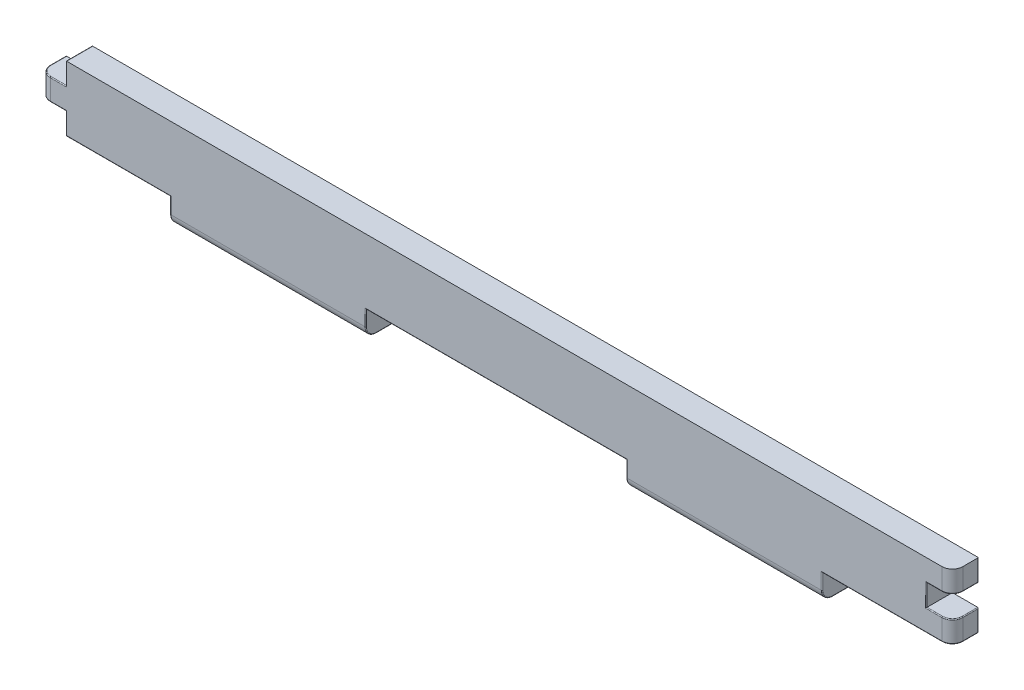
ISO-10303-21;
HEADER;
FILE_DESCRIPTION(('STEP AP214'),'2;1');
FILE_NAME('part.step','',(''),(''),'','','');
FILE_SCHEMA(('AUTOMOTIVE_DESIGN { 1 0 10303 214 1 1 1 1 }'));
ENDSEC;
DATA;
#1=APPLICATION_CONTEXT('core data for automotive mechanical design processes');
#2=APPLICATION_PROTOCOL_DEFINITION('international standard','automotive_design',2000,#1);
#3=PRODUCT_CONTEXT('',#1,'mechanical');
#4=PRODUCT('Part','Part','',(#3));
#5=PRODUCT_RELATED_PRODUCT_CATEGORY('part','',(#4));
#6=PRODUCT_DEFINITION_FORMATION('','',#4);
#7=PRODUCT_DEFINITION_CONTEXT('part definition',#1,'design');
#8=PRODUCT_DEFINITION('design','',#6,#7);
#9=PRODUCT_DEFINITION_SHAPE('','',#8);
#10=(LENGTH_UNIT() NAMED_UNIT(*) SI_UNIT(.MILLI.,.METRE.));
#11=(NAMED_UNIT(*) PLANE_ANGLE_UNIT() SI_UNIT($,.RADIAN.));
#12=(NAMED_UNIT(*) SI_UNIT($,.STERADIAN.) SOLID_ANGLE_UNIT());
#13=UNCERTAINTY_MEASURE_WITH_UNIT(LENGTH_MEASURE(1.E-05),#10,'distance_accuracy_value','');
#14=(GEOMETRIC_REPRESENTATION_CONTEXT(3) GLOBAL_UNCERTAINTY_ASSIGNED_CONTEXT((#13)) GLOBAL_UNIT_ASSIGNED_CONTEXT((#10,
#11,#12)) REPRESENTATION_CONTEXT('',''));
#15=CARTESIAN_POINT('',(0.,0.,0.));
#16=DIRECTION('',(0.,0.,1.));
#17=DIRECTION('',(1.,0.,0.));
#18=AXIS2_PLACEMENT_3D('',#15,#16,#17);
#19=CARTESIAN_POINT('',(0.,0.,10.));
#20=DIRECTION('',(0.,0.,1.));
#21=DIRECTION('',(1.,0.,0.));
#22=AXIS2_PLACEMENT_3D('',#19,#20,#21);
#23=PLANE('',#22);
#24=DIRECTION('',(0.,-1.,0.));
#25=VECTOR('',#24,1.);
#26=CARTESIAN_POINT('',(-164.7,0.,10.));
#27=LINE('',#26,#25);
#28=CARTESIAN_POINT('',(-164.7,17.5,10.));
#29=VERTEX_POINT('',#28);
#30=CARTESIAN_POINT('',(-164.7,8.86666666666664,10.));
#31=VERTEX_POINT('',#30);
#32=EDGE_CURVE('E517',#29,#31,#27,.T.);
#33=ORIENTED_EDGE('',*,*,#32,.T.);
#34=DIRECTION('',(-1.,0.,0.));
#35=VECTOR('',#34,1.);
#36=CARTESIAN_POINT('',(0.,8.86666666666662,10.));
#37=LINE('',#36,#35);
#38=CARTESIAN_POINT('',(-171.,8.86666666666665,10.));
#39=VERTEX_POINT('',#38);
#40=EDGE_CURVE('E519',#31,#39,#37,.T.);
#41=ORIENTED_EDGE('',*,*,#40,.T.);
#42=DIRECTION('',(0.,1.,0.));
#43=VECTOR('',#42,1.);
#44=CARTESIAN_POINT('',(-171.,0.,10.));
#45=LINE('',#44,#43);
#46=CARTESIAN_POINT('',(-171.,1.13333333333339,10.));
#47=VERTEX_POINT('',#46);
#48=EDGE_CURVE('E410',#39,#47,#45,.F.);
#49=ORIENTED_EDGE('',*,*,#48,.T.);
#50=DIRECTION('',(-1.,0.,0.));
#51=VECTOR('',#50,1.);
#52=CARTESIAN_POINT('',(-165.,1.13333333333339,10.));
#53=LINE('',#52,#51);
#54=CARTESIAN_POINT('',(-164.7,1.13333333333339,10.));
#55=VERTEX_POINT('',#54);
#56=EDGE_CURVE('E499',#47,#55,#53,.F.);
#57=ORIENTED_EDGE('',*,*,#56,.T.);
#58=DIRECTION('',(0.,1.,0.));
#59=VECTOR('',#58,1.);
#60=CARTESIAN_POINT('',(-164.7,-7.50000000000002,10.));
#61=LINE('',#60,#59);
#62=CARTESIAN_POINT('',(-164.7,-7.20000000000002,10.));
#63=VERTEX_POINT('',#62);
#64=EDGE_CURVE('E495',#55,#63,#61,.F.);
#65=ORIENTED_EDGE('',*,*,#64,.T.);
#66=DIRECTION('',(1.,0.,0.));
#67=VECTOR('',#66,1.);
#68=CARTESIAN_POINT('',(0.,-7.19999999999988,10.));
#69=LINE('',#68,#67);
#70=CARTESIAN_POINT('',(-124.7,-7.19999999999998,10.));
#71=VERTEX_POINT('',#70);
#72=EDGE_CURVE('E493',#63,#71,#69,.T.);
#73=ORIENTED_EDGE('',*,*,#72,.T.);
#74=DIRECTION('',(0.,1.,0.));
#75=VECTOR('',#74,1.);
#76=CARTESIAN_POINT('',(-124.7,-13.5,10.));
#77=LINE('',#76,#75);
#78=CARTESIAN_POINT('',(-124.7,-13.5,10.));
#79=VERTEX_POINT('',#78);
#80=EDGE_CURVE('E497',#71,#79,#77,.F.);
#81=ORIENTED_EDGE('',*,*,#80,.T.);
#82=DIRECTION('',(-1.,0.,0.));
#83=VECTOR('',#82,1.);
#84=CARTESIAN_POINT('',(0.,-13.5,10.));
#85=LINE('',#84,#83);
#86=CARTESIAN_POINT('',(-50.3000000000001,-13.5,10.));
#87=VERTEX_POINT('',#86);
#88=EDGE_CURVE('E418',#79,#87,#85,.F.);
#89=ORIENTED_EDGE('',*,*,#88,.T.);
#90=DIRECTION('',(0.,1.,0.));
#91=VECTOR('',#90,1.);
#92=CARTESIAN_POINT('',(-50.3000000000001,0.,10.));
#93=LINE('',#92,#91);
#94=CARTESIAN_POINT('',(-50.3000000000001,-7.19999999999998,10.));
#95=VERTEX_POINT('',#94);
#96=EDGE_CURVE('E503',#87,#95,#93,.T.);
#97=ORIENTED_EDGE('',*,*,#96,.T.);
#98=DIRECTION('',(1.,0.,0.));
#99=VECTOR('',#98,1.);
#100=CARTESIAN_POINT('',(0.,-7.2,10.));
#101=LINE('',#100,#99);
#102=CARTESIAN_POINT('',(50.2999999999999,-7.20000000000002,10.));
#103=VERTEX_POINT('',#102);
#104=EDGE_CURVE('E501',#95,#103,#101,.T.);
#105=ORIENTED_EDGE('',*,*,#104,.T.);
#106=DIRECTION('',(0.,1.,0.));
#107=VECTOR('',#106,1.);
#108=CARTESIAN_POINT('',(50.2999999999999,-13.5,10.));
#109=LINE('',#108,#107);
#110=CARTESIAN_POINT('',(50.2999999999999,-13.5,10.));
#111=VERTEX_POINT('',#110);
#112=EDGE_CURVE('E505',#103,#111,#109,.F.);
#113=ORIENTED_EDGE('',*,*,#112,.T.);
#114=DIRECTION('',(-1.,0.,0.));
#115=VECTOR('',#114,1.);
#116=CARTESIAN_POINT('',(0.,-13.5,10.));
#117=LINE('',#116,#115);
#118=CARTESIAN_POINT('',(124.7,-13.5,10.));
#119=VERTEX_POINT('',#118);
#120=EDGE_CURVE('E421',#111,#119,#117,.F.);
#121=ORIENTED_EDGE('',*,*,#120,.T.);
#122=DIRECTION('',(0.,1.,0.));
#123=VECTOR('',#122,1.);
#124=CARTESIAN_POINT('',(124.7,0.,10.));
#125=LINE('',#124,#123);
#126=CARTESIAN_POINT('',(124.7,-7.19999999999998,10.));
#127=VERTEX_POINT('',#126);
#128=EDGE_CURVE('E509',#119,#127,#125,.T.);
#129=ORIENTED_EDGE('',*,*,#128,.T.);
#130=DIRECTION('',(1.,0.,0.));
#131=VECTOR('',#130,1.);
#132=CARTESIAN_POINT('',(0.,-7.19999999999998,10.));
#133=LINE('',#132,#131);
#134=CARTESIAN_POINT('',(171.,-7.19999999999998,10.));
#135=VERTEX_POINT('',#134);
#136=EDGE_CURVE('E507',#127,#135,#133,.T.);
#137=ORIENTED_EDGE('',*,*,#136,.T.);
#138=DIRECTION('',(0.,1.,0.));
#139=VECTOR('',#138,1.);
#140=CARTESIAN_POINT('',(171.,0.840000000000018,10.));
#141=LINE('',#140,#139);
#142=CARTESIAN_POINT('',(171.,0.540000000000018,10.));
#143=VERTEX_POINT('',#142);
#144=EDGE_CURVE('E415',#135,#143,#141,.T.);
#145=ORIENTED_EDGE('',*,*,#144,.T.);
#146=DIRECTION('',(-1.,0.,0.));
#147=VECTOR('',#146,1.);
#148=CARTESIAN_POINT('',(0.,0.540000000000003,10.));
#149=LINE('',#148,#147);
#150=CARTESIAN_POINT('',(164.7,0.540000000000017,10.));
#151=VERTEX_POINT('',#150);
#152=EDGE_CURVE('E515',#143,#151,#149,.T.);
#153=ORIENTED_EDGE('',*,*,#152,.T.);
#154=DIRECTION('',(0.,1.,0.));
#155=VECTOR('',#154,1.);
#156=CARTESIAN_POINT('',(164.7,0.,10.));
#157=LINE('',#156,#155);
#158=CARTESIAN_POINT('',(164.7,9.47000000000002,10.));
#159=VERTEX_POINT('',#158);
#160=EDGE_CURVE('E511',#151,#159,#157,.T.);
#161=ORIENTED_EDGE('',*,*,#160,.T.);
#162=DIRECTION('',(-1.,0.,0.));
#163=VECTOR('',#162,1.);
#164=CARTESIAN_POINT('',(171.,9.47000000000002,10.));
#165=LINE('',#164,#163);
#166=CARTESIAN_POINT('',(171.,9.47000000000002,10.));
#167=VERTEX_POINT('',#166);
#168=EDGE_CURVE('E513',#159,#167,#165,.F.);
#169=ORIENTED_EDGE('',*,*,#168,.T.);
#170=DIRECTION('',(0.,1.,0.));
#171=VECTOR('',#170,1.);
#172=CARTESIAN_POINT('',(171.,17.5,10.));
#173=LINE('',#172,#171);
#174=CARTESIAN_POINT('',(171.,17.5,10.));
#175=VERTEX_POINT('',#174);
#176=EDGE_CURVE('E413',#167,#175,#173,.T.);
#177=ORIENTED_EDGE('',*,*,#176,.T.);
#178=DIRECTION('',(-1.,0.,0.));
#179=VECTOR('',#178,1.);
#180=CARTESIAN_POINT('',(175.,17.5,10.));
#181=LINE('',#180,#179);
#182=EDGE_CURVE('E396',#175,#29,#181,.T.);
#183=ORIENTED_EDGE('',*,*,#182,.T.);
#184=EDGE_LOOP('',(#33,#41,#49,#57,#65,#73,#81,#89,#97,#105,#113,#121,#129,#137,#145,#153,#161,
#169,#177,#183));
#185=FACE_BOUND('',#184,.T.);
#186=ADVANCED_FACE('F33',(#185),#23,.T.);
#187=CARTESIAN_POINT('',(0.,0.,0.));
#188=DIRECTION('',(0.,0.,1.));
#189=DIRECTION('',(1.,0.,0.));
#190=AXIS2_PLACEMENT_3D('',#187,#188,#189);
#191=PLANE('',#190);
#192=DIRECTION('',(-1.,0.,0.));
#193=VECTOR('',#192,1.);
#194=CARTESIAN_POINT('',(175.,-17.5,0.));
#195=LINE('',#194,#193);
#196=CARTESIAN_POINT('',(124.7,-17.5,0.));
#197=VERTEX_POINT('',#196);
#198=CARTESIAN_POINT('',(50.2999999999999,-17.5,0.));
#199=VERTEX_POINT('',#198);
#200=EDGE_CURVE('E400',#197,#199,#195,.T.);
#201=ORIENTED_EDGE('',*,*,#200,.T.);
#202=CARTESIAN_POINT('',(50.2999999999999,-17.2,0.));
#203=DIRECTION('',(0.,0.,1.));
#204=DIRECTION('',(1.,0.,0.));
#205=AXIS2_PLACEMENT_3D('',#202,#203,#204);
#206=CIRCLE('',#205,0.3);
#207=CARTESIAN_POINT('',(49.9999999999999,-17.2,0.));
#208=VERTEX_POINT('',#207);
#209=EDGE_CURVE('E462',#199,#208,#206,.F.);
#210=ORIENTED_EDGE('',*,*,#209,.T.);
#211=DIRECTION('',(0.,1.,0.));
#212=VECTOR('',#211,1.);
#213=CARTESIAN_POINT('',(49.9999999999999,0.,0.));
#214=LINE('',#213,#212);
#215=CARTESIAN_POINT('',(49.9999999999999,-7.50000000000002,0.));
#216=VERTEX_POINT('',#215);
#217=EDGE_CURVE('E353',#208,#216,#214,.T.);
#218=ORIENTED_EDGE('',*,*,#217,.T.);
#219=DIRECTION('',(1.,0.,0.));
#220=VECTOR('',#219,1.);
#221=CARTESIAN_POINT('',(0.,-7.5,0.));
#222=LINE('',#221,#220);
#223=CARTESIAN_POINT('',(-50.0000000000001,-7.49999999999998,0.));
#224=VERTEX_POINT('',#223);
#225=EDGE_CURVE('E355',#224,#216,#222,.T.);
#226=ORIENTED_EDGE('',*,*,#225,.F.);
#227=DIRECTION('',(0.,1.,0.));
#228=VECTOR('',#227,1.);
#229=CARTESIAN_POINT('',(-50.0000000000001,0.,0.));
#230=LINE('',#229,#228);
#231=CARTESIAN_POINT('',(-50.,-17.2,0.));
#232=VERTEX_POINT('',#231);
#233=EDGE_CURVE('E359',#232,#224,#230,.T.);
#234=ORIENTED_EDGE('',*,*,#233,.F.);
#235=CARTESIAN_POINT('',(-50.3,-17.2,0.));
#236=DIRECTION('',(0.,0.,1.));
#237=DIRECTION('',(1.,0.,0.));
#238=AXIS2_PLACEMENT_3D('',#235,#236,#237);
#239=CIRCLE('',#238,0.3);
#240=CARTESIAN_POINT('',(-50.3,-17.5,0.));
#241=VERTEX_POINT('',#240);
#242=EDGE_CURVE('E458',#232,#241,#239,.F.);
#243=ORIENTED_EDGE('',*,*,#242,.T.);
#244=CARTESIAN_POINT('',(-124.7,-17.5,0.));
#245=VERTEX_POINT('',#244);
#246=EDGE_CURVE('E403',#241,#245,#195,.T.);
#247=ORIENTED_EDGE('',*,*,#246,.T.);
#248=CARTESIAN_POINT('',(-124.7,-17.2,0.));
#249=DIRECTION('',(0.,0.,1.));
#250=DIRECTION('',(1.,0.,0.));
#251=AXIS2_PLACEMENT_3D('',#248,#249,#250);
#252=CIRCLE('',#251,0.3);
#253=CARTESIAN_POINT('',(-125.,-17.2,0.));
#254=VERTEX_POINT('',#253);
#255=EDGE_CURVE('E325',#245,#254,#252,.F.);
#256=ORIENTED_EDGE('',*,*,#255,.T.);
#257=DIRECTION('',(0.,1.,0.));
#258=VECTOR('',#257,1.);
#259=CARTESIAN_POINT('',(-125.,0.,0.));
#260=LINE('',#259,#258);
#261=CARTESIAN_POINT('',(-125.,-7.49999999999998,0.));
#262=VERTEX_POINT('',#261);
#263=EDGE_CURVE('E317',#254,#262,#260,.T.);
#264=ORIENTED_EDGE('',*,*,#263,.T.);
#265=DIRECTION('',(1.,0.,0.));
#266=VECTOR('',#265,1.);
#267=CARTESIAN_POINT('',(0.,-7.49999999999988,0.));
#268=LINE('',#267,#266);
#269=CARTESIAN_POINT('',(-165.,-7.50000000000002,0.));
#270=VERTEX_POINT('',#269);
#271=EDGE_CURVE('E322',#270,#262,#268,.T.);
#272=ORIENTED_EDGE('',*,*,#271,.F.);
#273=DIRECTION('',(0.,1.,0.));
#274=VECTOR('',#273,1.);
#275=CARTESIAN_POINT('',(-165.,0.,0.));
#276=LINE('',#275,#274);
#277=CARTESIAN_POINT('',(-165.,0.833333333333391,0.));
#278=VERTEX_POINT('',#277);
#279=EDGE_CURVE('E340',#270,#278,#276,.T.);
#280=ORIENTED_EDGE('',*,*,#279,.T.);
#281=DIRECTION('',(-1.,0.,0.));
#282=VECTOR('',#281,1.);
#283=CARTESIAN_POINT('',(0.,0.833333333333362,0.));
#284=LINE('',#283,#282);
#285=CARTESIAN_POINT('',(-174.7,0.833333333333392,0.));
#286=VERTEX_POINT('',#285);
#287=EDGE_CURVE('E345',#278,#286,#284,.T.);
#288=ORIENTED_EDGE('',*,*,#287,.T.);
#289=DIRECTION('',(0.,1.,0.));
#290=VECTOR('',#289,1.);
#291=CARTESIAN_POINT('',(-174.7,9.16666666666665,0.));
#292=LINE('',#291,#290);
#293=CARTESIAN_POINT('',(-174.7,9.16666666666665,0.));
#294=VERTEX_POINT('',#293);
#295=EDGE_CURVE('E449',#286,#294,#292,.T.);
#296=ORIENTED_EDGE('',*,*,#295,.T.);
#297=DIRECTION('',(-1.,0.,0.));
#298=VECTOR('',#297,1.);
#299=CARTESIAN_POINT('',(0.,9.16666666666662,0.));
#300=LINE('',#299,#298);
#301=CARTESIAN_POINT('',(-165.,9.16666666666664,0.));
#302=VERTEX_POINT('',#301);
#303=EDGE_CURVE('E387',#302,#294,#300,.T.);
#304=ORIENTED_EDGE('',*,*,#303,.F.);
#305=DIRECTION('',(0.,-1.,0.));
#306=VECTOR('',#305,1.);
#307=CARTESIAN_POINT('',(-165.,0.,0.));
#308=LINE('',#307,#306);
#309=CARTESIAN_POINT('',(-165.,17.2,0.));
#310=VERTEX_POINT('',#309);
#311=EDGE_CURVE('E390',#310,#302,#308,.T.);
#312=ORIENTED_EDGE('',*,*,#311,.F.);
#313=CARTESIAN_POINT('',(-164.7,17.2,0.));
#314=DIRECTION('',(0.,0.,1.));
#315=DIRECTION('',(1.,0.,0.));
#316=AXIS2_PLACEMENT_3D('',#313,#314,#315);
#317=CIRCLE('',#316,0.3);
#318=CARTESIAN_POINT('',(-164.7,17.5,0.));
#319=VERTEX_POINT('',#318);
#320=EDGE_CURVE('E455',#310,#319,#317,.F.);
#321=ORIENTED_EDGE('',*,*,#320,.T.);
#322=DIRECTION('',(-1.,0.,0.));
#323=VECTOR('',#322,1.);
#324=CARTESIAN_POINT('',(175.,17.5,0.));
#325=LINE('',#324,#323);
#326=CARTESIAN_POINT('',(174.7,17.5,0.));
#327=VERTEX_POINT('',#326);
#328=EDGE_CURVE('E395',#327,#319,#325,.T.);
#329=ORIENTED_EDGE('',*,*,#328,.F.);
#330=DIRECTION('',(0.,1.,0.));
#331=VECTOR('',#330,1.);
#332=CARTESIAN_POINT('',(174.7,0.,0.));
#333=LINE('',#332,#331);
#334=CARTESIAN_POINT('',(174.7,9.17000000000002,0.));
#335=VERTEX_POINT('',#334);
#336=EDGE_CURVE('E453',#327,#335,#333,.F.);
#337=ORIENTED_EDGE('',*,*,#336,.T.);
#338=DIRECTION('',(-1.,0.,0.));
#339=VECTOR('',#338,1.);
#340=CARTESIAN_POINT('',(0.,9.17000000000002,0.));
#341=LINE('',#340,#339);
#342=CARTESIAN_POINT('',(165.,9.17000000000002,0.));
#343=VERTEX_POINT('',#342);
#344=EDGE_CURVE('E380',#335,#343,#341,.T.);
#345=ORIENTED_EDGE('',*,*,#344,.T.);
#346=DIRECTION('',(0.,1.,0.));
#347=VECTOR('',#346,1.);
#348=CARTESIAN_POINT('',(165.,0.,0.));
#349=LINE('',#348,#347);
#350=CARTESIAN_POINT('',(165.,0.840000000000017,0.));
#351=VERTEX_POINT('',#350);
#352=EDGE_CURVE('E374',#351,#343,#349,.T.);
#353=ORIENTED_EDGE('',*,*,#352,.F.);
#354=DIRECTION('',(-1.,0.,0.));
#355=VECTOR('',#354,1.);
#356=CARTESIAN_POINT('',(0.,0.840000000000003,0.));
#357=LINE('',#356,#355);
#358=CARTESIAN_POINT('',(174.7,0.840000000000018,0.));
#359=VERTEX_POINT('',#358);
#360=EDGE_CURVE('E377',#359,#351,#357,.T.);
#361=ORIENTED_EDGE('',*,*,#360,.F.);
#362=DIRECTION('',(0.,1.,0.));
#363=VECTOR('',#362,1.);
#364=CARTESIAN_POINT('',(174.7,0.,0.));
#365=LINE('',#364,#363);
#366=CARTESIAN_POINT('',(174.7,-7.49999999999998,0.));
#367=VERTEX_POINT('',#366);
#368=EDGE_CURVE('E451',#359,#367,#365,.F.);
#369=ORIENTED_EDGE('',*,*,#368,.T.);
#370=DIRECTION('',(1.,0.,0.));
#371=VECTOR('',#370,1.);
#372=CARTESIAN_POINT('',(0.,-7.49999999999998,0.));
#373=LINE('',#372,#371);
#374=CARTESIAN_POINT('',(125.,-7.49999999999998,0.));
#375=VERTEX_POINT('',#374);
#376=EDGE_CURVE('E366',#375,#367,#373,.T.);
#377=ORIENTED_EDGE('',*,*,#376,.F.);
#378=DIRECTION('',(0.,1.,0.));
#379=VECTOR('',#378,1.);
#380=CARTESIAN_POINT('',(125.,0.,0.));
#381=LINE('',#380,#379);
#382=CARTESIAN_POINT('',(125.,-17.2,0.));
#383=VERTEX_POINT('',#382);
#384=EDGE_CURVE('E369',#383,#375,#381,.T.);
#385=ORIENTED_EDGE('',*,*,#384,.F.);
#386=CARTESIAN_POINT('',(124.7,-17.2,0.));
#387=DIRECTION('',(0.,0.,1.));
#388=DIRECTION('',(1.,0.,0.));
#389=AXIS2_PLACEMENT_3D('',#386,#387,#388);
#390=CIRCLE('',#389,0.3);
#391=EDGE_CURVE('E460',#383,#197,#390,.F.);
#392=ORIENTED_EDGE('',*,*,#391,.T.);
#393=EDGE_LOOP('',(#201,#210,#218,#226,#234,#243,#247,#256,#264,#272,#280,#288,#296,#304,#312,
#321,#329,#337,#345,#353,#361,#369,#377,#385,#392));
#394=FACE_BOUND('',#393,.T.);
#395=ADVANCED_FACE('F320',(#394),#191,.F.);
#396=CARTESIAN_POINT('',(175.,-17.5,10.));
#397=DIRECTION('',(-1.,0.,0.));
#398=DIRECTION('',(0.,0.,1.));
#399=AXIS2_PLACEMENT_3D('',#396,#397,#398);
#400=PLANE('',#399);
#401=DIRECTION('',(0.,1.,0.));
#402=VECTOR('',#401,1.);
#403=CARTESIAN_POINT('',(175.,-7.49999999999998,6.));
#404=LINE('',#403,#402);
#405=CARTESIAN_POINT('',(175.,0.540000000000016,6.));
#406=VERTEX_POINT('',#405);
#407=CARTESIAN_POINT('',(175.,-7.19999999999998,6.));
#408=VERTEX_POINT('',#407);
#409=EDGE_CURVE('E427',#406,#408,#404,.F.);
#410=ORIENTED_EDGE('',*,*,#409,.T.);
#411=DIRECTION('',(0.,0.,1.));
#412=VECTOR('',#411,1.);
#413=CARTESIAN_POINT('',(175.,-7.19999999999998,0.));
#414=LINE('',#413,#412);
#415=CARTESIAN_POINT('',(175.,-7.19999999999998,0.3));
#416=VERTEX_POINT('',#415);
#417=EDGE_CURVE('E549',#408,#416,#414,.F.);
#418=ORIENTED_EDGE('',*,*,#417,.T.);
#419=DIRECTION('',(0.,1.,0.));
#420=VECTOR('',#419,1.);
#421=CARTESIAN_POINT('',(175.,-17.5,0.3));
#422=LINE('',#421,#420);
#423=CARTESIAN_POINT('',(175.,0.540000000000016,0.3));
#424=VERTEX_POINT('',#423);
#425=EDGE_CURVE('E547',#416,#424,#422,.T.);
#426=ORIENTED_EDGE('',*,*,#425,.T.);
#427=DIRECTION('',(0.,0.,1.));
#428=VECTOR('',#427,1.);
#429=CARTESIAN_POINT('',(175.,0.540000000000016,6.));
#430=LINE('',#429,#428);
#431=EDGE_CURVE('E545',#424,#406,#430,.T.);
#432=ORIENTED_EDGE('',*,*,#431,.T.);
#433=EDGE_LOOP('',(#410,#418,#426,#432));
#434=FACE_BOUND('',#433,.T.);
#435=ADVANCED_FACE('F911',(#434),#400,.F.);
#436=CARTESIAN_POINT('',(175.,-17.5,10.));
#437=DIRECTION('',(0.,-1.,0.));
#438=DIRECTION('',(1.,0.,0.));
#439=AXIS2_PLACEMENT_3D('',#436,#437,#438);
#440=PLANE('',#439);
#441=ORIENTED_EDGE('',*,*,#246,.F.);
#442=DIRECTION('',(0.,0.,1.));
#443=VECTOR('',#442,1.);
#444=CARTESIAN_POINT('',(-50.3,-17.5,10.));
#445=LINE('',#444,#443);
#446=CARTESIAN_POINT('',(-50.3,-17.5,6.));
#447=VERTEX_POINT('',#446);
#448=EDGE_CURVE('E476',#241,#447,#445,.T.);
#449=ORIENTED_EDGE('',*,*,#448,.T.);
#450=DIRECTION('',(-1.,0.,0.));
#451=VECTOR('',#450,1.);
#452=CARTESIAN_POINT('',(175.,-17.5,6.));
#453=LINE('',#452,#451);
#454=CARTESIAN_POINT('',(-124.7,-17.5,6.));
#455=VERTEX_POINT('',#454);
#456=EDGE_CURVE('E424',#447,#455,#453,.T.);
#457=ORIENTED_EDGE('',*,*,#456,.T.);
#458=DIRECTION('',(0.,0.,1.));
#459=VECTOR('',#458,1.);
#460=CARTESIAN_POINT('',(-124.7,-17.5,0.));
#461=LINE('',#460,#459);
#462=EDGE_CURVE('E474',#455,#245,#461,.F.);
#463=ORIENTED_EDGE('',*,*,#462,.T.);
#464=EDGE_LOOP('',(#441,#449,#457,#463));
#465=FACE_BOUND('',#464,.T.);
#466=ADVANCED_FACE('F861',(#465),#440,.T.);
#467=DIRECTION('',(-1.,0.,0.));
#468=VECTOR('',#467,1.);
#469=CARTESIAN_POINT('',(175.,-17.5,6.));
#470=LINE('',#469,#468);
#471=CARTESIAN_POINT('',(124.7,-17.5,6.));
#472=VERTEX_POINT('',#471);
#473=CARTESIAN_POINT('',(50.2999999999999,-17.5,6.));
#474=VERTEX_POINT('',#473);
#475=EDGE_CURVE('E407',#472,#474,#470,.T.);
#476=ORIENTED_EDGE('',*,*,#475,.T.);
#477=DIRECTION('',(0.,0.,1.));
#478=VECTOR('',#477,1.);
#479=CARTESIAN_POINT('',(50.2999999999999,-17.5,0.));
#480=LINE('',#479,#478);
#481=EDGE_CURVE('E447',#474,#199,#480,.F.);
#482=ORIENTED_EDGE('',*,*,#481,.T.);
#483=ORIENTED_EDGE('',*,*,#200,.F.);
#484=DIRECTION('',(0.,0.,1.));
#485=VECTOR('',#484,1.);
#486=CARTESIAN_POINT('',(124.7,-17.5,10.));
#487=LINE('',#486,#485);
#488=EDGE_CURVE('E444',#197,#472,#487,.T.);
#489=ORIENTED_EDGE('',*,*,#488,.T.);
#490=EDGE_LOOP('',(#476,#482,#483,#489));
#491=FACE_BOUND('',#490,.T.);
#492=ADVANCED_FACE('F806',(#491),#440,.T.);
#493=CARTESIAN_POINT('',(175.,17.5,10.));
#494=DIRECTION('',(0.,-1.,0.));
#495=DIRECTION('',(1.,0.,0.));
#496=AXIS2_PLACEMENT_3D('',#493,#494,#495);
#497=PLANE('',#496);
#498=ORIENTED_EDGE('',*,*,#328,.T.);
#499=DIRECTION('',(0.,0.,1.));
#500=VECTOR('',#499,1.);
#501=CARTESIAN_POINT('',(-164.7,17.5,10.));
#502=LINE('',#501,#500);
#503=EDGE_CURVE('E569',#319,#29,#502,.T.);
#504=ORIENTED_EDGE('',*,*,#503,.T.);
#505=ORIENTED_EDGE('',*,*,#182,.F.);
#506=CARTESIAN_POINT('',(171.,17.5,6.));
#507=DIRECTION('',(0.,-1.,0.));
#508=DIRECTION('',(1.,0.,0.));
#509=AXIS2_PLACEMENT_3D('',#506,#507,#508);
#510=CIRCLE('',#509,4.);
#511=CARTESIAN_POINT('',(175.,17.5,6.));
#512=VERTEX_POINT('',#511);
#513=EDGE_CURVE('E430',#175,#512,#510,.F.);
#514=ORIENTED_EDGE('',*,*,#513,.T.);
#515=DIRECTION('',(0.,0.,-1.));
#516=VECTOR('',#515,1.);
#517=CARTESIAN_POINT('',(175.,17.5,10.));
#518=LINE('',#517,#516);
#519=CARTESIAN_POINT('',(175.,17.5,0.3));
#520=VERTEX_POINT('',#519);
#521=EDGE_CURVE('E399',#512,#520,#518,.T.);
#522=ORIENTED_EDGE('',*,*,#521,.T.);
#523=CARTESIAN_POINT('',(174.7,17.5,0.3));
#524=DIRECTION('',(0.,-1.,0.));
#525=DIRECTION('',(1.,0.,0.));
#526=AXIS2_PLACEMENT_3D('',#523,#524,#525);
#527=CIRCLE('',#526,0.3);
#528=EDGE_CURVE('E567',#520,#327,#527,.F.);
#529=ORIENTED_EDGE('',*,*,#528,.T.);
#530=EDGE_LOOP('',(#498,#504,#505,#514,#522,#529));
#531=FACE_BOUND('',#530,.T.);
#532=ADVANCED_FACE('F731',(#531),#497,.F.);
#533=CARTESIAN_POINT('',(-175.,-17.5,10.));
#534=DIRECTION('',(-1.,0.,0.));
#535=DIRECTION('',(0.,0.,1.));
#536=AXIS2_PLACEMENT_3D('',#533,#534,#535);
#537=PLANE('',#536);
#538=DIRECTION('',(0.,1.,0.));
#539=VECTOR('',#538,1.);
#540=CARTESIAN_POINT('',(-175.,0.833333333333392,0.3));
#541=LINE('',#540,#539);
#542=CARTESIAN_POINT('',(-175.,8.86666666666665,0.3));
#543=VERTEX_POINT('',#542);
#544=CARTESIAN_POINT('',(-175.,1.13333333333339,0.3));
#545=VERTEX_POINT('',#544);
#546=EDGE_CURVE('E42',#543,#545,#541,.F.);
#547=ORIENTED_EDGE('',*,*,#546,.T.);
#548=DIRECTION('',(0.,0.,1.));
#549=VECTOR('',#548,1.);
#550=CARTESIAN_POINT('',(-175.,1.13333333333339,6.));
#551=LINE('',#550,#549);
#552=CARTESIAN_POINT('',(-175.,1.13333333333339,6.));
#553=VERTEX_POINT('',#552);
#554=EDGE_CURVE('E11',#545,#553,#551,.T.);
#555=ORIENTED_EDGE('',*,*,#554,.T.);
#556=DIRECTION('',(0.,1.,0.));
#557=VECTOR('',#556,1.);
#558=CARTESIAN_POINT('',(-175.,-17.5,6.));
#559=LINE('',#558,#557);
#560=CARTESIAN_POINT('',(-175.,8.86666666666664,6.));
#561=VERTEX_POINT('',#560);
#562=EDGE_CURVE('E435',#553,#561,#559,.T.);
#563=ORIENTED_EDGE('',*,*,#562,.T.);
#564=DIRECTION('',(0.,0.,1.));
#565=VECTOR('',#564,1.);
#566=CARTESIAN_POINT('',(-175.,8.86666666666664,10.));
#567=LINE('',#566,#565);
#568=EDGE_CURVE('E53',#561,#543,#567,.F.);
#569=ORIENTED_EDGE('',*,*,#568,.T.);
#570=EDGE_LOOP('',(#547,#555,#563,#569));
#571=FACE_BOUND('',#570,.T.);
#572=ADVANCED_FACE('F716',(#571),#537,.T.);
#573=DIRECTION('',(0.,0.,1.));
#574=VECTOR('',#573,1.);
#575=CARTESIAN_POINT('',(175.,9.47000000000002,10.));
#576=LINE('',#575,#574);
#577=CARTESIAN_POINT('',(175.,9.47000000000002,6.));
#578=VERTEX_POINT('',#577);
#579=CARTESIAN_POINT('',(175.,9.47000000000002,0.3));
#580=VERTEX_POINT('',#579);
#581=EDGE_CURVE('E579',#578,#580,#576,.F.);
#582=ORIENTED_EDGE('',*,*,#581,.T.);
#583=DIRECTION('',(0.,1.,0.));
#584=VECTOR('',#583,1.);
#585=CARTESIAN_POINT('',(175.,-17.5,0.3));
#586=LINE('',#585,#584);
#587=EDGE_CURVE('E581',#580,#520,#586,.T.);
#588=ORIENTED_EDGE('',*,*,#587,.T.);
#589=ORIENTED_EDGE('',*,*,#521,.F.);
#590=DIRECTION('',(0.,1.,0.));
#591=VECTOR('',#590,1.);
#592=CARTESIAN_POINT('',(175.,9.17000000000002,6.));
#593=LINE('',#592,#591);
#594=EDGE_CURVE('E432',#512,#578,#593,.F.);
#595=ORIENTED_EDGE('',*,*,#594,.T.);
#596=EDGE_LOOP('',(#582,#588,#589,#595));
#597=FACE_BOUND('',#596,.T.);
#598=ADVANCED_FACE('F920',(#597),#400,.F.);
#599=CARTESIAN_POINT('',(0.,9.16666666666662,0.));
#600=DIRECTION('',(0.,1.,0.));
#601=DIRECTION('',(-1.,0.,0.));
#602=AXIS2_PLACEMENT_3D('',#599,#600,#601);
#603=PLANE('',#602);
#604=CARTESIAN_POINT('',(-171.,9.16666666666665,6.));
#605=DIRECTION('',(0.,1.,0.));
#606=DIRECTION('',(-1.,0.,0.));
#607=AXIS2_PLACEMENT_3D('',#604,#605,#606);
#608=CIRCLE('',#607,3.7);
#609=CARTESIAN_POINT('',(-174.7,9.16666666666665,6.));
#610=VERTEX_POINT('',#609);
#611=CARTESIAN_POINT('',(-171.,9.16666666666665,9.7));
#612=VERTEX_POINT('',#611);
#613=EDGE_CURVE('E563',#610,#612,#608,.T.);
#614=ORIENTED_EDGE('',*,*,#613,.T.);
#615=DIRECTION('',(-1.,0.,0.));
#616=VECTOR('',#615,1.);
#617=CARTESIAN_POINT('',(0.,9.16666666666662,9.7));
#618=LINE('',#617,#616);
#619=CARTESIAN_POINT('',(-165.,9.16666666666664,9.7));
#620=VERTEX_POINT('',#619);
#621=EDGE_CURVE('E565',#612,#620,#618,.F.);
#622=ORIENTED_EDGE('',*,*,#621,.T.);
#623=DIRECTION('',(0.,0.,1.));
#624=VECTOR('',#623,1.);
#625=CARTESIAN_POINT('',(-165.,9.16666666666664,0.));
#626=LINE('',#625,#624);
#627=EDGE_CURVE('E392',#302,#620,#626,.T.);
#628=ORIENTED_EDGE('',*,*,#627,.F.);
#629=ORIENTED_EDGE('',*,*,#303,.T.);
#630=DIRECTION('',(0.,0.,1.));
#631=VECTOR('',#630,1.);
#632=CARTESIAN_POINT('',(-174.7,9.16666666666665,0.));
#633=LINE('',#632,#631);
#634=EDGE_CURVE('E561',#294,#610,#633,.T.);
#635=ORIENTED_EDGE('',*,*,#634,.T.);
#636=EDGE_LOOP('',(#614,#622,#628,#629,#635));
#637=FACE_BOUND('',#636,.T.);
#638=ADVANCED_FACE('F702',(#637),#603,.T.);
#639=CARTESIAN_POINT('',(-165.,0.,0.));
#640=DIRECTION('',(-1.,0.,0.));
#641=DIRECTION('',(0.,0.,1.));
#642=AXIS2_PLACEMENT_3D('',#639,#640,#641);
#643=PLANE('',#642);
#644=DIRECTION('',(0.,-1.,0.));
#645=VECTOR('',#644,1.);
#646=CARTESIAN_POINT('',(-165.,0.,9.7));
#647=LINE('',#646,#645);
#648=CARTESIAN_POINT('',(-165.,17.2,9.7));
#649=VERTEX_POINT('',#648);
#650=EDGE_CURVE('E571',#620,#649,#647,.F.);
#651=ORIENTED_EDGE('',*,*,#650,.T.);
#652=DIRECTION('',(0.,0.,1.));
#653=VECTOR('',#652,1.);
#654=CARTESIAN_POINT('',(-165.,17.2,0.));
#655=LINE('',#654,#653);
#656=EDGE_CURVE('E573',#649,#310,#655,.F.);
#657=ORIENTED_EDGE('',*,*,#656,.T.);
#658=ORIENTED_EDGE('',*,*,#311,.T.);
#659=ORIENTED_EDGE('',*,*,#627,.T.);
#660=EDGE_LOOP('',(#651,#657,#658,#659));
#661=FACE_BOUND('',#660,.T.);
#662=ADVANCED_FACE('F695',(#661),#643,.T.);
#663=CARTESIAN_POINT('',(0.,-7.49999999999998,0.));
#664=DIRECTION('',(0.,-1.,0.));
#665=DIRECTION('',(0.,0.,-1.));
#666=AXIS2_PLACEMENT_3D('',#663,#664,#665);
#667=PLANE('',#666);
#668=ORIENTED_EDGE('',*,*,#376,.T.);
#669=DIRECTION('',(0.,0.,1.));
#670=VECTOR('',#669,1.);
#671=CARTESIAN_POINT('',(174.7,-7.49999999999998,6.));
#672=LINE('',#671,#670);
#673=CARTESIAN_POINT('',(174.7,-7.49999999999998,6.));
#674=VERTEX_POINT('',#673);
#675=EDGE_CURVE('E543',#367,#674,#672,.T.);
#676=ORIENTED_EDGE('',*,*,#675,.T.);
#677=CARTESIAN_POINT('',(171.,-7.49999999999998,6.));
#678=DIRECTION('',(0.,-1.,0.));
#679=DIRECTION('',(0.,0.,-1.));
#680=AXIS2_PLACEMENT_3D('',#677,#678,#679);
#681=CIRCLE('',#680,3.7);
#682=CARTESIAN_POINT('',(171.,-7.49999999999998,9.7));
#683=VERTEX_POINT('',#682);
#684=EDGE_CURVE('E541',#674,#683,#681,.T.);
#685=ORIENTED_EDGE('',*,*,#684,.T.);
#686=DIRECTION('',(1.,0.,0.));
#687=VECTOR('',#686,1.);
#688=CARTESIAN_POINT('',(0.,-7.49999999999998,9.7));
#689=LINE('',#688,#687);
#690=CARTESIAN_POINT('',(125.,-7.49999999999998,9.7));
#691=VERTEX_POINT('',#690);
#692=EDGE_CURVE('E539',#683,#691,#689,.F.);
#693=ORIENTED_EDGE('',*,*,#692,.T.);
#694=DIRECTION('',(0.,0.,1.));
#695=VECTOR('',#694,1.);
#696=CARTESIAN_POINT('',(125.,-7.49999999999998,0.));
#697=LINE('',#696,#695);
#698=EDGE_CURVE('E356',#375,#691,#697,.T.);
#699=ORIENTED_EDGE('',*,*,#698,.F.);
#700=EDGE_LOOP('',(#668,#676,#685,#693,#699));
#701=FACE_BOUND('',#700,.T.);
#702=ADVANCED_FACE('F791',(#701),#667,.T.);
#703=CARTESIAN_POINT('',(125.,0.,0.));
#704=DIRECTION('',(1.,0.,0.));
#705=DIRECTION('',(0.,0.,-1.));
#706=AXIS2_PLACEMENT_3D('',#703,#704,#705);
#707=PLANE('',#706);
#708=CARTESIAN_POINT('',(125.,-13.5,6.));
#709=DIRECTION('',(1.,0.,0.));
#710=DIRECTION('',(0.,0.,-1.));
#711=AXIS2_PLACEMENT_3D('',#708,#709,#710);
#712=CIRCLE('',#711,3.7);
#713=CARTESIAN_POINT('',(125.,-13.5,9.7));
#714=VERTEX_POINT('',#713);
#715=CARTESIAN_POINT('',(125.,-17.2,6.));
#716=VERTEX_POINT('',#715);
#717=EDGE_CURVE('E470',#714,#716,#712,.T.);
#718=ORIENTED_EDGE('',*,*,#717,.T.);
#719=DIRECTION('',(0.,0.,1.));
#720=VECTOR('',#719,1.);
#721=CARTESIAN_POINT('',(125.,-17.2,0.));
#722=LINE('',#721,#720);
#723=EDGE_CURVE('E472',#716,#383,#722,.F.);
#724=ORIENTED_EDGE('',*,*,#723,.T.);
#725=ORIENTED_EDGE('',*,*,#384,.T.);
#726=ORIENTED_EDGE('',*,*,#698,.T.);
#727=DIRECTION('',(0.,1.,0.));
#728=VECTOR('',#727,1.);
#729=CARTESIAN_POINT('',(125.,0.,9.7));
#730=LINE('',#729,#728);
#731=EDGE_CURVE('E468',#691,#714,#730,.F.);
#732=ORIENTED_EDGE('',*,*,#731,.T.);
#733=EDGE_LOOP('',(#718,#724,#725,#726,#732));
#734=FACE_BOUND('',#733,.T.);
#735=ADVANCED_FACE('F1303',(#734),#707,.T.);
#736=CARTESIAN_POINT('',(-50.0000000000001,0.,0.));
#737=DIRECTION('',(1.,0.,0.));
#738=DIRECTION('',(0.,1.,0.));
#739=AXIS2_PLACEMENT_3D('',#736,#737,#738);
#740=PLANE('',#739);
#741=CARTESIAN_POINT('',(-50.,-13.5,6.));
#742=DIRECTION('',(1.,0.,0.));
#743=DIRECTION('',(0.,1.,0.));
#744=AXIS2_PLACEMENT_3D('',#741,#742,#743);
#745=CIRCLE('',#744,3.7);
#746=CARTESIAN_POINT('',(-50.,-13.5,9.7));
#747=VERTEX_POINT('',#746);
#748=CARTESIAN_POINT('',(-50.,-17.2,6.));
#749=VERTEX_POINT('',#748);
#750=EDGE_CURVE('E480',#747,#749,#745,.T.);
#751=ORIENTED_EDGE('',*,*,#750,.T.);
#752=DIRECTION('',(0.,0.,1.));
#753=VECTOR('',#752,1.);
#754=CARTESIAN_POINT('',(-50.,-17.2,0.));
#755=LINE('',#754,#753);
#756=EDGE_CURVE('E482',#749,#232,#755,.F.);
#757=ORIENTED_EDGE('',*,*,#756,.T.);
#758=ORIENTED_EDGE('',*,*,#233,.T.);
#759=DIRECTION('',(0.,0.,1.));
#760=VECTOR('',#759,1.);
#761=CARTESIAN_POINT('',(-50.0000000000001,-7.49999999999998,0.));
#762=LINE('',#761,#760);
#763=CARTESIAN_POINT('',(-50.0000000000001,-7.49999999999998,9.7));
#764=VERTEX_POINT('',#763);
#765=EDGE_CURVE('E330',#224,#764,#762,.T.);
#766=ORIENTED_EDGE('',*,*,#765,.T.);
#767=DIRECTION('',(0.,1.,0.));
#768=VECTOR('',#767,1.);
#769=CARTESIAN_POINT('',(-50.0000000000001,0.,9.7));
#770=LINE('',#769,#768);
#771=EDGE_CURVE('E478',#764,#747,#770,.F.);
#772=ORIENTED_EDGE('',*,*,#771,.T.);
#773=EDGE_LOOP('',(#751,#757,#758,#766,#772));
#774=FACE_BOUND('',#773,.T.);
#775=ADVANCED_FACE('F848',(#774),#740,.T.);
#776=CARTESIAN_POINT('',(0.,-7.5,0.));
#777=DIRECTION('',(0.,-1.,0.));
#778=DIRECTION('',(1.,0.,0.));
#779=AXIS2_PLACEMENT_3D('',#776,#777,#778);
#780=PLANE('',#779);
#781=DIRECTION('',(0.,0.,1.));
#782=VECTOR('',#781,1.);
#783=CARTESIAN_POINT('',(49.9999999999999,-7.50000000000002,0.));
#784=LINE('',#783,#782);
#785=CARTESIAN_POINT('',(49.9999999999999,-7.50000000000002,9.7));
#786=VERTEX_POINT('',#785);
#787=EDGE_CURVE('E361',#216,#786,#784,.T.);
#788=ORIENTED_EDGE('',*,*,#787,.T.);
#789=DIRECTION('',(1.,0.,0.));
#790=VECTOR('',#789,1.);
#791=CARTESIAN_POINT('',(0.,-7.5,9.7));
#792=LINE('',#791,#790);
#793=EDGE_CURVE('E583',#786,#764,#792,.F.);
#794=ORIENTED_EDGE('',*,*,#793,.T.);
#795=ORIENTED_EDGE('',*,*,#765,.F.);
#796=ORIENTED_EDGE('',*,*,#225,.T.);
#797=EDGE_LOOP('',(#788,#794,#795,#796));
#798=FACE_BOUND('',#797,.T.);
#799=ADVANCED_FACE('F829',(#798),#780,.T.);
#800=CARTESIAN_POINT('',(49.9999999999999,0.,0.));
#801=DIRECTION('',(1.,0.,0.));
#802=DIRECTION('',(0.,0.,-1.));
#803=AXIS2_PLACEMENT_3D('',#800,#801,#802);
#804=PLANE('',#803);
#805=ORIENTED_EDGE('',*,*,#217,.F.);
#806=DIRECTION('',(0.,0.,1.));
#807=VECTOR('',#806,1.);
#808=CARTESIAN_POINT('',(49.9999999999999,-17.2,6.));
#809=LINE('',#808,#807);
#810=CARTESIAN_POINT('',(49.9999999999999,-17.2,6.));
#811=VERTEX_POINT('',#810);
#812=EDGE_CURVE('E441',#208,#811,#809,.T.);
#813=ORIENTED_EDGE('',*,*,#812,.T.);
#814=CARTESIAN_POINT('',(49.9999999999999,-13.5,6.));
#815=DIRECTION('',(1.,0.,0.));
#816=DIRECTION('',(0.,0.,-1.));
#817=AXIS2_PLACEMENT_3D('',#814,#815,#816);
#818=CIRCLE('',#817,3.7);
#819=CARTESIAN_POINT('',(49.9999999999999,-13.5,9.7));
#820=VERTEX_POINT('',#819);
#821=EDGE_CURVE('E439',#811,#820,#818,.F.);
#822=ORIENTED_EDGE('',*,*,#821,.T.);
#823=DIRECTION('',(0.,1.,0.));
#824=VECTOR('',#823,1.);
#825=CARTESIAN_POINT('',(49.9999999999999,-7.50000000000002,9.7));
#826=LINE('',#825,#824);
#827=EDGE_CURVE('E437',#820,#786,#826,.T.);
#828=ORIENTED_EDGE('',*,*,#827,.T.);
#829=ORIENTED_EDGE('',*,*,#787,.F.);
#830=EDGE_LOOP('',(#805,#813,#822,#828,#829));
#831=FACE_BOUND('',#830,.T.);
#832=ADVANCED_FACE('F825',(#831),#804,.F.);
#833=CARTESIAN_POINT('',(0.,0.833333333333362,0.));
#834=DIRECTION('',(0.,1.,0.));
#835=DIRECTION('',(-1.,0.,0.));
#836=AXIS2_PLACEMENT_3D('',#833,#834,#835);
#837=PLANE('',#836);
#838=DIRECTION('',(0.,0.,1.));
#839=VECTOR('',#838,1.);
#840=CARTESIAN_POINT('',(-165.,0.833333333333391,0.));
#841=LINE('',#840,#839);
#842=CARTESIAN_POINT('',(-165.,0.833333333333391,9.7));
#843=VERTEX_POINT('',#842);
#844=EDGE_CURVE('E347',#278,#843,#841,.T.);
#845=ORIENTED_EDGE('',*,*,#844,.T.);
#846=DIRECTION('',(-1.,0.,0.));
#847=VECTOR('',#846,1.);
#848=CARTESIAN_POINT('',(-171.,0.833333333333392,9.7));
#849=LINE('',#848,#847);
#850=CARTESIAN_POINT('',(-171.,0.833333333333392,9.7));
#851=VERTEX_POINT('',#850);
#852=EDGE_CURVE('E555',#843,#851,#849,.T.);
#853=ORIENTED_EDGE('',*,*,#852,.T.);
#854=CARTESIAN_POINT('',(-171.,0.833333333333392,6.));
#855=DIRECTION('',(0.,1.,0.));
#856=DIRECTION('',(-1.,0.,0.));
#857=AXIS2_PLACEMENT_3D('',#854,#855,#856);
#858=CIRCLE('',#857,3.7);
#859=CARTESIAN_POINT('',(-174.7,0.833333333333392,6.));
#860=VERTEX_POINT('',#859);
#861=EDGE_CURVE('E553',#851,#860,#858,.F.);
#862=ORIENTED_EDGE('',*,*,#861,.T.);
#863=DIRECTION('',(0.,0.,1.));
#864=VECTOR('',#863,1.);
#865=CARTESIAN_POINT('',(-174.7,0.833333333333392,0.));
#866=LINE('',#865,#864);
#867=EDGE_CURVE('E551',#860,#286,#866,.F.);
#868=ORIENTED_EDGE('',*,*,#867,.T.);
#869=ORIENTED_EDGE('',*,*,#287,.F.);
#870=EDGE_LOOP('',(#845,#853,#862,#868,#869));
#871=FACE_BOUND('',#870,.T.);
#872=ADVANCED_FACE('F894',(#871),#837,.F.);
#873=CARTESIAN_POINT('',(-165.,0.,0.));
#874=DIRECTION('',(1.,0.,0.));
#875=DIRECTION('',(0.,0.,-1.));
#876=AXIS2_PLACEMENT_3D('',#873,#874,#875);
#877=PLANE('',#876);
#878=DIRECTION('',(0.,0.,1.));
#879=VECTOR('',#878,1.);
#880=CARTESIAN_POINT('',(-165.,-7.50000000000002,0.));
#881=LINE('',#880,#879);
#882=CARTESIAN_POINT('',(-165.,-7.50000000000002,9.7));
#883=VERTEX_POINT('',#882);
#884=EDGE_CURVE('E338',#270,#883,#881,.T.);
#885=ORIENTED_EDGE('',*,*,#884,.T.);
#886=DIRECTION('',(0.,1.,0.));
#887=VECTOR('',#886,1.);
#888=CARTESIAN_POINT('',(-165.,0.833333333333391,9.7));
#889=LINE('',#888,#887);
#890=EDGE_CURVE('E575',#883,#843,#889,.T.);
#891=ORIENTED_EDGE('',*,*,#890,.T.);
#892=ORIENTED_EDGE('',*,*,#844,.F.);
#893=ORIENTED_EDGE('',*,*,#279,.F.);
#894=EDGE_LOOP('',(#885,#891,#892,#893));
#895=FACE_BOUND('',#894,.T.);
#896=ADVANCED_FACE('F882',(#895),#877,.F.);
#897=CARTESIAN_POINT('',(0.,-7.49999999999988,0.));
#898=DIRECTION('',(0.,-1.,0.));
#899=DIRECTION('',(1.,0.,0.));
#900=AXIS2_PLACEMENT_3D('',#897,#898,#899);
#901=PLANE('',#900);
#902=DIRECTION('',(0.,0.,1.));
#903=VECTOR('',#902,1.);
#904=CARTESIAN_POINT('',(-125.,-7.49999999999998,0.));
#905=LINE('',#904,#903);
#906=CARTESIAN_POINT('',(-125.,-7.49999999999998,9.7));
#907=VERTEX_POINT('',#906);
#908=EDGE_CURVE('E335',#262,#907,#905,.T.);
#909=ORIENTED_EDGE('',*,*,#908,.T.);
#910=DIRECTION('',(1.,0.,0.));
#911=VECTOR('',#910,1.);
#912=CARTESIAN_POINT('',(0.,-7.49999999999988,9.7));
#913=LINE('',#912,#911);
#914=EDGE_CURVE('E585',#907,#883,#913,.F.);
#915=ORIENTED_EDGE('',*,*,#914,.T.);
#916=ORIENTED_EDGE('',*,*,#884,.F.);
#917=ORIENTED_EDGE('',*,*,#271,.T.);
#918=EDGE_LOOP('',(#909,#915,#916,#917));
#919=FACE_BOUND('',#918,.T.);
#920=ADVANCED_FACE('F334',(#919),#901,.T.);
#921=CARTESIAN_POINT('',(-125.,0.,0.));
#922=DIRECTION('',(1.,0.,0.));
#923=DIRECTION('',(0.,0.,-1.));
#924=AXIS2_PLACEMENT_3D('',#921,#922,#923);
#925=PLANE('',#924);
#926=ORIENTED_EDGE('',*,*,#263,.F.);
#927=DIRECTION('',(0.,0.,1.));
#928=VECTOR('',#927,1.);
#929=CARTESIAN_POINT('',(-125.,-17.2,6.));
#930=LINE('',#929,#928);
#931=CARTESIAN_POINT('',(-125.,-17.2,6.));
#932=VERTEX_POINT('',#931);
#933=EDGE_CURVE('E491',#254,#932,#930,.T.);
#934=ORIENTED_EDGE('',*,*,#933,.T.);
#935=CARTESIAN_POINT('',(-125.,-13.5,6.));
#936=DIRECTION('',(1.,0.,0.));
#937=DIRECTION('',(0.,0.,-1.));
#938=AXIS2_PLACEMENT_3D('',#935,#936,#937);
#939=CIRCLE('',#938,3.7);
#940=CARTESIAN_POINT('',(-125.,-13.5,9.7));
#941=VERTEX_POINT('',#940);
#942=EDGE_CURVE('E489',#932,#941,#939,.F.);
#943=ORIENTED_EDGE('',*,*,#942,.T.);
#944=DIRECTION('',(0.,1.,0.));
#945=VECTOR('',#944,1.);
#946=CARTESIAN_POINT('',(-125.,-7.49999999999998,9.7));
#947=LINE('',#946,#945);
#948=EDGE_CURVE('E344',#941,#907,#947,.T.);
#949=ORIENTED_EDGE('',*,*,#948,.T.);
#950=ORIENTED_EDGE('',*,*,#908,.F.);
#951=EDGE_LOOP('',(#926,#934,#943,#949,#950));
#952=FACE_BOUND('',#951,.T.);
#953=ADVANCED_FACE('F342',(#952),#925,.F.);
#954=CARTESIAN_POINT('',(165.,0.,0.));
#955=DIRECTION('',(1.,0.,0.));
#956=DIRECTION('',(0.,0.,-1.));
#957=AXIS2_PLACEMENT_3D('',#954,#955,#956);
#958=PLANE('',#957);
#959=DIRECTION('',(0.,0.,1.));
#960=VECTOR('',#959,1.);
#961=CARTESIAN_POINT('',(165.,9.17000000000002,0.));
#962=LINE('',#961,#960);
#963=CARTESIAN_POINT('',(165.,9.17000000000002,9.7));
#964=VERTEX_POINT('',#963);
#965=EDGE_CURVE('E370',#343,#964,#962,.T.);
#966=ORIENTED_EDGE('',*,*,#965,.T.);
#967=DIRECTION('',(0.,1.,0.));
#968=VECTOR('',#967,1.);
#969=CARTESIAN_POINT('',(165.,0.,9.7));
#970=LINE('',#969,#968);
#971=CARTESIAN_POINT('',(165.,0.840000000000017,9.7));
#972=VERTEX_POINT('',#971);
#973=EDGE_CURVE('E577',#964,#972,#970,.F.);
#974=ORIENTED_EDGE('',*,*,#973,.T.);
#975=DIRECTION('',(0.,0.,1.));
#976=VECTOR('',#975,1.);
#977=CARTESIAN_POINT('',(165.,0.840000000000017,0.));
#978=LINE('',#977,#976);
#979=EDGE_CURVE('E382',#351,#972,#978,.T.);
#980=ORIENTED_EDGE('',*,*,#979,.F.);
#981=ORIENTED_EDGE('',*,*,#352,.T.);
#982=EDGE_LOOP('',(#966,#974,#980,#981));
#983=FACE_BOUND('',#982,.T.);
#984=ADVANCED_FACE('F754',(#983),#958,.T.);
#985=CARTESIAN_POINT('',(0.,9.17000000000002,0.));
#986=DIRECTION('',(0.,1.,0.));
#987=DIRECTION('',(0.,0.,1.));
#988=AXIS2_PLACEMENT_3D('',#985,#986,#987);
#989=PLANE('',#988);
#990=CARTESIAN_POINT('',(171.,9.17000000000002,6.));
#991=DIRECTION('',(0.,1.,0.));
#992=DIRECTION('',(0.,0.,1.));
#993=AXIS2_PLACEMENT_3D('',#990,#991,#992);
#994=CIRCLE('',#993,3.7);
#995=CARTESIAN_POINT('',(174.7,9.17000000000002,6.));
#996=VERTEX_POINT('',#995);
#997=CARTESIAN_POINT('',(171.,9.17000000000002,9.7));
#998=VERTEX_POINT('',#997);
#999=EDGE_CURVE('E533',#996,#998,#994,.F.);
#1000=ORIENTED_EDGE('',*,*,#999,.T.);
#1001=DIRECTION('',(-1.,0.,0.));
#1002=VECTOR('',#1001,1.);
#1003=CARTESIAN_POINT('',(165.,9.17000000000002,9.7));
#1004=LINE('',#1003,#1002);
#1005=EDGE_CURVE('E535',#998,#964,#1004,.T.);
#1006=ORIENTED_EDGE('',*,*,#1005,.T.);
#1007=ORIENTED_EDGE('',*,*,#965,.F.);
#1008=ORIENTED_EDGE('',*,*,#344,.F.);
#1009=DIRECTION('',(0.,0.,1.));
#1010=VECTOR('',#1009,1.);
#1011=CARTESIAN_POINT('',(174.7,9.17000000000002,0.));
#1012=LINE('',#1011,#1010);
#1013=EDGE_CURVE('E531',#335,#996,#1012,.T.);
#1014=ORIENTED_EDGE('',*,*,#1013,.T.);
#1015=EDGE_LOOP('',(#1000,#1006,#1007,#1008,#1014));
#1016=FACE_BOUND('',#1015,.T.);
#1017=ADVANCED_FACE('F747',(#1016),#989,.F.);
#1018=CARTESIAN_POINT('',(0.,0.840000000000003,0.));
#1019=DIRECTION('',(0.,1.,0.));
#1020=DIRECTION('',(-1.,0.,0.));
#1021=AXIS2_PLACEMENT_3D('',#1018,#1019,#1020);
#1022=PLANE('',#1021);
#1023=ORIENTED_EDGE('',*,*,#979,.T.);
#1024=DIRECTION('',(-1.,0.,0.));
#1025=VECTOR('',#1024,1.);
#1026=CARTESIAN_POINT('',(0.,0.840000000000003,9.7));
#1027=LINE('',#1026,#1025);
#1028=CARTESIAN_POINT('',(171.,0.840000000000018,9.7));
#1029=VERTEX_POINT('',#1028);
#1030=EDGE_CURVE('E525',#972,#1029,#1027,.F.);
#1031=ORIENTED_EDGE('',*,*,#1030,.T.);
#1032=CARTESIAN_POINT('',(171.,0.840000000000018,6.));
#1033=DIRECTION('',(0.,1.,0.));
#1034=DIRECTION('',(-1.,0.,0.));
#1035=AXIS2_PLACEMENT_3D('',#1032,#1033,#1034);
#1036=CIRCLE('',#1035,3.7);
#1037=CARTESIAN_POINT('',(174.7,0.840000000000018,6.));
#1038=VERTEX_POINT('',#1037);
#1039=EDGE_CURVE('E523',#1029,#1038,#1036,.T.);
#1040=ORIENTED_EDGE('',*,*,#1039,.T.);
#1041=DIRECTION('',(0.,0.,1.));
#1042=VECTOR('',#1041,1.);
#1043=CARTESIAN_POINT('',(174.7,0.840000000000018,0.));
#1044=LINE('',#1043,#1042);
#1045=EDGE_CURVE('E521',#1038,#359,#1044,.F.);
#1046=ORIENTED_EDGE('',*,*,#1045,.T.);
#1047=ORIENTED_EDGE('',*,*,#360,.T.);
#1048=EDGE_LOOP('',(#1023,#1031,#1040,#1046,#1047));
#1049=FACE_BOUND('',#1048,.T.);
#1050=ADVANCED_FACE('F759',(#1049),#1022,.T.);
#1051=CARTESIAN_POINT('',(175.,-13.5,6.));
#1052=DIRECTION('',(-1.,0.,0.));
#1053=DIRECTION('',(0.,-1.,0.));
#1054=AXIS2_PLACEMENT_3D('',#1051,#1052,#1053);
#1055=CYLINDRICAL_SURFACE('',#1054,4.);
#1056=ORIENTED_EDGE('',*,*,#120,.F.);
#1057=CARTESIAN_POINT('',(50.2999999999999,-13.5,6.));
#1058=DIRECTION('',(1.,0.,0.));
#1059=DIRECTION('',(0.,0.,-1.));
#1060=AXIS2_PLACEMENT_3D('',#1057,#1058,#1059);
#1061=CIRCLE('',#1060,4.);
#1062=EDGE_CURVE('E466',#111,#474,#1061,.T.);
#1063=ORIENTED_EDGE('',*,*,#1062,.T.);
#1064=ORIENTED_EDGE('',*,*,#475,.F.);
#1065=CARTESIAN_POINT('',(124.7,-13.5,6.));
#1066=DIRECTION('',(1.,0.,0.));
#1067=DIRECTION('',(0.,0.,-1.));
#1068=AXIS2_PLACEMENT_3D('',#1065,#1066,#1067);
#1069=CIRCLE('',#1068,4.);
#1070=EDGE_CURVE('E464',#472,#119,#1069,.F.);
#1071=ORIENTED_EDGE('',*,*,#1070,.T.);
#1072=EDGE_LOOP('',(#1056,#1063,#1064,#1071));
#1073=FACE_BOUND('',#1072,.T.);
#1074=ADVANCED_FACE('F810',(#1073),#1055,.T.);
#1075=CARTESIAN_POINT('',(175.,-13.5,6.));
#1076=DIRECTION('',(-1.,0.,0.));
#1077=DIRECTION('',(0.,-1.,0.));
#1078=AXIS2_PLACEMENT_3D('',#1075,#1076,#1077);
#1079=CYLINDRICAL_SURFACE('',#1078,4.);
#1080=ORIENTED_EDGE('',*,*,#456,.F.);
#1081=CARTESIAN_POINT('',(-50.3,-13.5,6.));
#1082=DIRECTION('',(1.,0.,0.));
#1083=DIRECTION('',(0.,1.,0.));
#1084=AXIS2_PLACEMENT_3D('',#1081,#1082,#1083);
#1085=CIRCLE('',#1084,4.);
#1086=EDGE_CURVE('E486',#447,#87,#1085,.F.);
#1087=ORIENTED_EDGE('',*,*,#1086,.T.);
#1088=ORIENTED_EDGE('',*,*,#88,.F.);
#1089=CARTESIAN_POINT('',(-124.7,-13.5,6.));
#1090=DIRECTION('',(1.,0.,0.));
#1091=DIRECTION('',(0.,0.,-1.));
#1092=AXIS2_PLACEMENT_3D('',#1089,#1090,#1091);
#1093=CIRCLE('',#1092,4.);
#1094=EDGE_CURVE('E484',#79,#455,#1093,.T.);
#1095=ORIENTED_EDGE('',*,*,#1094,.T.);
#1096=EDGE_LOOP('',(#1080,#1087,#1088,#1095));
#1097=FACE_BOUND('',#1096,.T.);
#1098=ADVANCED_FACE('F928',(#1097),#1079,.T.);
#1099=CARTESIAN_POINT('',(171.,0.,6.));
#1100=DIRECTION('',(0.,-1.,0.));
#1101=DIRECTION('',(0.,0.,-1.));
#1102=AXIS2_PLACEMENT_3D('',#1099,#1100,#1101);
#1103=CYLINDRICAL_SURFACE('',#1102,4.);
#1104=ORIENTED_EDGE('',*,*,#409,.F.);
#1105=CARTESIAN_POINT('',(171.,0.540000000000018,6.));
#1106=DIRECTION('',(0.,1.,0.));
#1107=DIRECTION('',(-1.,0.,0.));
#1108=AXIS2_PLACEMENT_3D('',#1105,#1106,#1107);
#1109=CIRCLE('',#1108,4.);
#1110=EDGE_CURVE('E529',#406,#143,#1109,.F.);
#1111=ORIENTED_EDGE('',*,*,#1110,.T.);
#1112=ORIENTED_EDGE('',*,*,#144,.F.);
#1113=CARTESIAN_POINT('',(171.,-7.19999999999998,6.));
#1114=DIRECTION('',(0.,-1.,0.));
#1115=DIRECTION('',(0.,0.,-1.));
#1116=AXIS2_PLACEMENT_3D('',#1113,#1114,#1115);
#1117=CIRCLE('',#1116,4.);
#1118=EDGE_CURVE('E527',#135,#408,#1117,.F.);
#1119=ORIENTED_EDGE('',*,*,#1118,.T.);
#1120=EDGE_LOOP('',(#1104,#1111,#1112,#1119));
#1121=FACE_BOUND('',#1120,.T.);
#1122=ADVANCED_FACE('F931',(#1121),#1103,.T.);
#1123=CARTESIAN_POINT('',(171.,0.,6.));
#1124=DIRECTION('',(0.,-1.,0.));
#1125=DIRECTION('',(0.,0.,-1.));
#1126=AXIS2_PLACEMENT_3D('',#1123,#1124,#1125);
#1127=CYLINDRICAL_SURFACE('',#1126,4.);
#1128=ORIENTED_EDGE('',*,*,#176,.F.);
#1129=CARTESIAN_POINT('',(171.,9.47000000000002,6.));
#1130=DIRECTION('',(0.,1.,0.));
#1131=DIRECTION('',(0.,0.,1.));
#1132=AXIS2_PLACEMENT_3D('',#1129,#1130,#1131);
#1133=CIRCLE('',#1132,4.);
#1134=EDGE_CURVE('E537',#167,#578,#1133,.T.);
#1135=ORIENTED_EDGE('',*,*,#1134,.T.);
#1136=ORIENTED_EDGE('',*,*,#594,.F.);
#1137=ORIENTED_EDGE('',*,*,#513,.F.);
#1138=EDGE_LOOP('',(#1128,#1135,#1136,#1137));
#1139=FACE_BOUND('',#1138,.T.);
#1140=ADVANCED_FACE('F935',(#1139),#1127,.T.);
#1141=CARTESIAN_POINT('',(-171.,-17.5,6.));
#1142=DIRECTION('',(0.,1.,0.));
#1143=DIRECTION('',(0.,0.,1.));
#1144=AXIS2_PLACEMENT_3D('',#1141,#1142,#1143);
#1145=CYLINDRICAL_SURFACE('',#1144,4.);
#1146=ORIENTED_EDGE('',*,*,#562,.F.);
#1147=CARTESIAN_POINT('',(-171.,1.13333333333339,6.));
#1148=DIRECTION('',(0.,1.,0.));
#1149=DIRECTION('',(-1.,0.,0.));
#1150=AXIS2_PLACEMENT_3D('',#1147,#1148,#1149);
#1151=CIRCLE('',#1150,4.);
#1152=EDGE_CURVE('E559',#553,#47,#1151,.T.);
#1153=ORIENTED_EDGE('',*,*,#1152,.T.);
#1154=ORIENTED_EDGE('',*,*,#48,.F.);
#1155=CARTESIAN_POINT('',(-171.,8.86666666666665,6.));
#1156=DIRECTION('',(0.,1.,0.));
#1157=DIRECTION('',(-1.,0.,0.));
#1158=AXIS2_PLACEMENT_3D('',#1155,#1156,#1157);
#1159=CIRCLE('',#1158,4.);
#1160=EDGE_CURVE('E557',#39,#561,#1159,.F.);
#1161=ORIENTED_EDGE('',*,*,#1160,.T.);
#1162=EDGE_LOOP('',(#1146,#1153,#1154,#1161));
#1163=FACE_BOUND('',#1162,.T.);
#1164=ADVANCED_FACE('F718',(#1163),#1145,.T.);
#1165=CARTESIAN_POINT('',(-50.3,-17.2,10.));
#1166=DIRECTION('',(0.,0.,1.));
#1167=DIRECTION('',(1.,0.,0.));
#1168=AXIS2_PLACEMENT_3D('',#1165,#1166,#1167);
#1169=CYLINDRICAL_SURFACE('',#1168,0.3);
#1170=ORIENTED_EDGE('',*,*,#242,.F.);
#1171=ORIENTED_EDGE('',*,*,#756,.F.);
#1172=CARTESIAN_POINT('',(-50.3,-17.2,6.));
#1173=DIRECTION('',(0.,0.,1.));
#1174=DIRECTION('',(1.,0.,0.));
#1175=AXIS2_PLACEMENT_3D('',#1172,#1173,#1174);
#1176=CIRCLE('',#1175,0.3);
#1177=EDGE_CURVE('E378',#447,#749,#1176,.T.);
#1178=ORIENTED_EDGE('',*,*,#1177,.F.);
#1179=ORIENTED_EDGE('',*,*,#448,.F.);
#1180=EDGE_LOOP('',(#1170,#1171,#1178,#1179));
#1181=FACE_BOUND('',#1180,.T.);
#1182=ADVANCED_FACE('F857',(#1181),#1169,.T.);
#1183=CARTESIAN_POINT('',(-50.3,-13.5,6.));
#1184=DIRECTION('',(1.,0.,0.));
#1185=DIRECTION('',(0.,1.,0.));
#1186=AXIS2_PLACEMENT_3D('',#1183,#1184,#1185);
#1187=TOROIDAL_SURFACE('',#1186,3.7,0.3);
#1188=ORIENTED_EDGE('',*,*,#1177,.T.);
#1189=ORIENTED_EDGE('',*,*,#750,.F.);
#1190=CARTESIAN_POINT('',(-50.3,-13.5,9.7));
#1191=DIRECTION('',(0.,1.,0.));
#1192=DIRECTION('',(0.,0.,1.));
#1193=AXIS2_PLACEMENT_3D('',#1190,#1191,#1192);
#1194=CIRCLE('',#1193,0.3);
#1195=EDGE_CURVE('E601',#87,#747,#1194,.T.);
#1196=ORIENTED_EDGE('',*,*,#1195,.F.);
#1197=ORIENTED_EDGE('',*,*,#1086,.F.);
#1198=EDGE_LOOP('',(#1188,#1189,#1196,#1197));
#1199=FACE_BOUND('',#1198,.T.);
#1200=ADVANCED_FACE('F851',(#1199),#1187,.T.);
#1201=CARTESIAN_POINT('',(-50.3000000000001,0.,9.7));
#1202=DIRECTION('',(0.,1.,0.));
#1203=DIRECTION('',(-1.,0.,0.));
#1204=AXIS2_PLACEMENT_3D('',#1201,#1202,#1203);
#1205=CYLINDRICAL_SURFACE('',#1204,0.3);
#1206=ORIENTED_EDGE('',*,*,#1195,.T.);
#1207=ORIENTED_EDGE('',*,*,#771,.F.);
#1208=CARTESIAN_POINT('',(-50.3000000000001,-7.19999999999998,9.7));
#1209=DIRECTION('',(0.707106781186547,0.707106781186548,0.));
#1210=DIRECTION('',(-0.707106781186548,0.707106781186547,0.));
#1211=AXIS2_PLACEMENT_3D('',#1208,#1209,#1210);
#1212=ELLIPSE('',#1211,0.424264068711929,0.3);
#1213=EDGE_CURVE('E598',#95,#764,#1212,.T.);
#1214=ORIENTED_EDGE('',*,*,#1213,.F.);
#1215=ORIENTED_EDGE('',*,*,#96,.F.);
#1216=EDGE_LOOP('',(#1206,#1207,#1214,#1215));
#1217=FACE_BOUND('',#1216,.T.);
#1218=ADVANCED_FACE('F845',(#1217),#1205,.T.);
#1219=CARTESIAN_POINT('',(0.,-7.2,9.7));
#1220=DIRECTION('',(1.,0.,0.));
#1221=DIRECTION('',(0.,1.,0.));
#1222=AXIS2_PLACEMENT_3D('',#1219,#1220,#1221);
#1223=CYLINDRICAL_SURFACE('',#1222,0.3);
#1224=ORIENTED_EDGE('',*,*,#1213,.T.);
#1225=ORIENTED_EDGE('',*,*,#793,.F.);
#1226=CARTESIAN_POINT('',(50.2999999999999,-7.20000000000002,9.7));
#1227=DIRECTION('',(0.707106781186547,-0.707106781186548,0.));
#1228=DIRECTION('',(-0.707106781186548,-0.707106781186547,0.));
#1229=AXIS2_PLACEMENT_3D('',#1226,#1227,#1228);
#1230=ELLIPSE('',#1229,0.424264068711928,0.3);
#1231=EDGE_CURVE('E595',#103,#786,#1230,.T.);
#1232=ORIENTED_EDGE('',*,*,#1231,.F.);
#1233=ORIENTED_EDGE('',*,*,#104,.F.);
#1234=EDGE_LOOP('',(#1224,#1225,#1232,#1233));
#1235=FACE_BOUND('',#1234,.T.);
#1236=ADVANCED_FACE('F833',(#1235),#1223,.T.);
#1237=CARTESIAN_POINT('',(50.2999999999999,0.,9.7));
#1238=DIRECTION('',(0.,-1.,0.));
#1239=DIRECTION('',(0.,0.,-1.));
#1240=AXIS2_PLACEMENT_3D('',#1237,#1238,#1239);
#1241=CYLINDRICAL_SURFACE('',#1240,0.3);
#1242=ORIENTED_EDGE('',*,*,#1231,.T.);
#1243=ORIENTED_EDGE('',*,*,#827,.F.);
#1244=CARTESIAN_POINT('',(50.2999999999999,-13.5,9.7));
#1245=DIRECTION('',(0.,-1.,0.));
#1246=DIRECTION('',(0.,0.,-1.));
#1247=AXIS2_PLACEMENT_3D('',#1244,#1245,#1246);
#1248=CIRCLE('',#1247,0.3);
#1249=EDGE_CURVE('E591',#111,#820,#1248,.T.);
#1250=ORIENTED_EDGE('',*,*,#1249,.F.);
#1251=ORIENTED_EDGE('',*,*,#112,.F.);
#1252=EDGE_LOOP('',(#1242,#1243,#1250,#1251));
#1253=FACE_BOUND('',#1252,.T.);
#1254=ADVANCED_FACE('F838',(#1253),#1241,.T.);
#1255=CARTESIAN_POINT('',(50.2999999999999,-13.5,6.));
#1256=DIRECTION('',(1.,0.,0.));
#1257=DIRECTION('',(0.,0.,-1.));
#1258=AXIS2_PLACEMENT_3D('',#1255,#1256,#1257);
#1259=TOROIDAL_SURFACE('',#1258,3.7,0.3);
#1260=ORIENTED_EDGE('',*,*,#1249,.T.);
#1261=ORIENTED_EDGE('',*,*,#821,.F.);
#1262=CARTESIAN_POINT('',(50.2999999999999,-17.2,6.));
#1263=DIRECTION('',(0.,0.,-1.));
#1264=DIRECTION('',(-1.,0.,0.));
#1265=AXIS2_PLACEMENT_3D('',#1262,#1263,#1264);
#1266=CIRCLE('',#1265,0.3);
#1267=EDGE_CURVE('E589',#474,#811,#1266,.T.);
#1268=ORIENTED_EDGE('',*,*,#1267,.F.);
#1269=ORIENTED_EDGE('',*,*,#1062,.F.);
#1270=EDGE_LOOP('',(#1260,#1261,#1268,#1269));
#1271=FACE_BOUND('',#1270,.T.);
#1272=ADVANCED_FACE('F815',(#1271),#1259,.T.);
#1273=CARTESIAN_POINT('',(50.2999999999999,-17.2,0.));
#1274=DIRECTION('',(0.,0.,-1.));
#1275=DIRECTION('',(-1.,0.,0.));
#1276=AXIS2_PLACEMENT_3D('',#1273,#1274,#1275);
#1277=CYLINDRICAL_SURFACE('',#1276,0.3);
#1278=ORIENTED_EDGE('',*,*,#209,.F.);
#1279=ORIENTED_EDGE('',*,*,#481,.F.);
#1280=ORIENTED_EDGE('',*,*,#1267,.T.);
#1281=ORIENTED_EDGE('',*,*,#812,.F.);
#1282=EDGE_LOOP('',(#1278,#1279,#1280,#1281));
#1283=FACE_BOUND('',#1282,.T.);
#1284=ADVANCED_FACE('F820',(#1283),#1277,.T.);
#1285=CARTESIAN_POINT('',(174.7,-17.5,0.3));
#1286=DIRECTION('',(0.,1.,0.));
#1287=DIRECTION('',(0.,0.,1.));
#1288=AXIS2_PLACEMENT_3D('',#1285,#1286,#1287);
#1289=CYLINDRICAL_SURFACE('',#1288,0.3);
#1290=ORIENTED_EDGE('',*,*,#528,.F.);
#1291=ORIENTED_EDGE('',*,*,#587,.F.);
#1292=CARTESIAN_POINT('',(174.7,9.47000000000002,0.3));
#1293=DIRECTION('',(0.,-0.707106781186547,0.707106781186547));
#1294=DIRECTION('',(0.,0.707106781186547,0.707106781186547));
#1295=AXIS2_PLACEMENT_3D('',#1292,#1293,#1294);
#1296=ELLIPSE('',#1295,0.424264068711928,0.3);
#1297=EDGE_CURVE('E592',#335,#580,#1296,.T.);
#1298=ORIENTED_EDGE('',*,*,#1297,.F.);
#1299=ORIENTED_EDGE('',*,*,#336,.F.);
#1300=EDGE_LOOP('',(#1290,#1291,#1298,#1299));
#1301=FACE_BOUND('',#1300,.T.);
#1302=ADVANCED_FACE('F738',(#1301),#1289,.T.);
#1303=CARTESIAN_POINT('',(174.7,9.47000000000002,0.));
#1304=DIRECTION('',(0.,0.,1.));
#1305=DIRECTION('',(1.,0.,0.));
#1306=AXIS2_PLACEMENT_3D('',#1303,#1304,#1305);
#1307=CYLINDRICAL_SURFACE('',#1306,0.3);
#1308=ORIENTED_EDGE('',*,*,#1297,.T.);
#1309=ORIENTED_EDGE('',*,*,#581,.F.);
#1310=CARTESIAN_POINT('',(174.7,9.47000000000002,6.));
#1311=DIRECTION('',(0.,0.,1.));
#1312=DIRECTION('',(1.,0.,0.));
#1313=AXIS2_PLACEMENT_3D('',#1310,#1311,#1312);
#1314=CIRCLE('',#1313,0.3);
#1315=EDGE_CURVE('E641',#996,#578,#1314,.T.);
#1316=ORIENTED_EDGE('',*,*,#1315,.F.);
#1317=ORIENTED_EDGE('',*,*,#1013,.F.);
#1318=EDGE_LOOP('',(#1308,#1309,#1316,#1317));
#1319=FACE_BOUND('',#1318,.T.);
#1320=ADVANCED_FACE('F744',(#1319),#1307,.T.);
#1321=CARTESIAN_POINT('',(171.,9.47000000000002,6.));
#1322=DIRECTION('',(0.,1.,0.));
#1323=DIRECTION('',(0.,0.,1.));
#1324=AXIS2_PLACEMENT_3D('',#1321,#1322,#1323);
#1325=TOROIDAL_SURFACE('',#1324,3.7,0.3);
#1326=ORIENTED_EDGE('',*,*,#1315,.T.);
#1327=ORIENTED_EDGE('',*,*,#1134,.F.);
#1328=CARTESIAN_POINT('',(171.,9.47000000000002,9.7));
#1329=DIRECTION('',(-1.,0.,0.));
#1330=DIRECTION('',(0.,0.,1.));
#1331=AXIS2_PLACEMENT_3D('',#1328,#1329,#1330);
#1332=CIRCLE('',#1331,0.3);
#1333=EDGE_CURVE('E638',#998,#167,#1332,.T.);
#1334=ORIENTED_EDGE('',*,*,#1333,.F.);
#1335=ORIENTED_EDGE('',*,*,#999,.F.);
#1336=EDGE_LOOP('',(#1326,#1327,#1334,#1335));
#1337=FACE_BOUND('',#1336,.T.);
#1338=ADVANCED_FACE('F989',(#1337),#1325,.T.);
#1339=CARTESIAN_POINT('',(0.,9.47000000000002,9.7));
#1340=DIRECTION('',(1.,0.,0.));
#1341=DIRECTION('',(0.,0.,-1.));
#1342=AXIS2_PLACEMENT_3D('',#1339,#1340,#1341);
#1343=CYLINDRICAL_SURFACE('',#1342,0.3);
#1344=ORIENTED_EDGE('',*,*,#1333,.T.);
#1345=ORIENTED_EDGE('',*,*,#168,.F.);
#1346=CARTESIAN_POINT('',(164.7,9.47000000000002,9.7));
#1347=DIRECTION('',(0.707106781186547,0.707106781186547,0.));
#1348=DIRECTION('',(0.707106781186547,-0.707106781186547,0.));
#1349=AXIS2_PLACEMENT_3D('',#1346,#1347,#1348);
#1350=ELLIPSE('',#1349,0.424264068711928,0.3);
#1351=EDGE_CURVE('E635',#964,#159,#1350,.F.);
#1352=ORIENTED_EDGE('',*,*,#1351,.F.);
#1353=ORIENTED_EDGE('',*,*,#1005,.F.);
#1354=EDGE_LOOP('',(#1344,#1345,#1352,#1353));
#1355=FACE_BOUND('',#1354,.T.);
#1356=ADVANCED_FACE('F986',(#1355),#1343,.T.);
#1357=CARTESIAN_POINT('',(164.7,0.,9.7));
#1358=DIRECTION('',(0.,1.,0.));
#1359=DIRECTION('',(0.,0.,1.));
#1360=AXIS2_PLACEMENT_3D('',#1357,#1358,#1359);
#1361=CYLINDRICAL_SURFACE('',#1360,0.3);
#1362=ORIENTED_EDGE('',*,*,#1351,.T.);
#1363=ORIENTED_EDGE('',*,*,#160,.F.);
#1364=CARTESIAN_POINT('',(164.7,0.540000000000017,9.7));
#1365=DIRECTION('',(-0.707106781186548,0.707106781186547,0.));
#1366=DIRECTION('',(-0.707106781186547,-0.707106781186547,0.));
#1367=AXIS2_PLACEMENT_3D('',#1364,#1365,#1366);
#1368=ELLIPSE('',#1367,0.424264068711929,0.3);
#1369=EDGE_CURVE('E632',#972,#151,#1368,.F.);
#1370=ORIENTED_EDGE('',*,*,#1369,.F.);
#1371=ORIENTED_EDGE('',*,*,#973,.F.);
#1372=EDGE_LOOP('',(#1362,#1363,#1370,#1371));
#1373=FACE_BOUND('',#1372,.T.);
#1374=ADVANCED_FACE('F764',(#1373),#1361,.T.);
#1375=CARTESIAN_POINT('',(0.,0.540000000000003,9.7));
#1376=DIRECTION('',(-1.,0.,0.));
#1377=DIRECTION('',(0.,-1.,0.));
#1378=AXIS2_PLACEMENT_3D('',#1375,#1376,#1377);
#1379=CYLINDRICAL_SURFACE('',#1378,0.3);
#1380=ORIENTED_EDGE('',*,*,#1369,.T.);
#1381=ORIENTED_EDGE('',*,*,#152,.F.);
#1382=CARTESIAN_POINT('',(171.,0.540000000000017,9.7));
#1383=DIRECTION('',(1.,0.,0.));
#1384=DIRECTION('',(0.,0.,-1.));
#1385=AXIS2_PLACEMENT_3D('',#1382,#1383,#1384);
#1386=CIRCLE('',#1385,0.3);
#1387=EDGE_CURVE('E629',#1029,#143,#1386,.T.);
#1388=ORIENTED_EDGE('',*,*,#1387,.F.);
#1389=ORIENTED_EDGE('',*,*,#1030,.F.);
#1390=EDGE_LOOP('',(#1380,#1381,#1388,#1389));
#1391=FACE_BOUND('',#1390,.T.);
#1392=ADVANCED_FACE('F767',(#1391),#1379,.T.);
#1393=CARTESIAN_POINT('',(171.,0.540000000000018,6.));
#1394=DIRECTION('',(0.,1.,0.));
#1395=DIRECTION('',(-1.,0.,0.));
#1396=AXIS2_PLACEMENT_3D('',#1393,#1394,#1395);
#1397=TOROIDAL_SURFACE('',#1396,3.7,0.3);
#1398=ORIENTED_EDGE('',*,*,#1387,.T.);
#1399=ORIENTED_EDGE('',*,*,#1110,.F.);
#1400=CARTESIAN_POINT('',(174.7,0.540000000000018,6.));
#1401=DIRECTION('',(0.,0.,-1.));
#1402=DIRECTION('',(-1.,0.,0.));
#1403=AXIS2_PLACEMENT_3D('',#1400,#1401,#1402);
#1404=CIRCLE('',#1403,0.3);
#1405=EDGE_CURVE('E626',#1038,#406,#1404,.T.);
#1406=ORIENTED_EDGE('',*,*,#1405,.F.);
#1407=ORIENTED_EDGE('',*,*,#1039,.F.);
#1408=EDGE_LOOP('',(#1398,#1399,#1406,#1407));
#1409=FACE_BOUND('',#1408,.T.);
#1410=ADVANCED_FACE('F772',(#1409),#1397,.T.);
#1411=CARTESIAN_POINT('',(174.7,0.540000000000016,10.));
#1412=DIRECTION('',(0.,0.,-1.));
#1413=DIRECTION('',(-1.,0.,0.));
#1414=AXIS2_PLACEMENT_3D('',#1411,#1412,#1413);
#1415=CYLINDRICAL_SURFACE('',#1414,0.3);
#1416=ORIENTED_EDGE('',*,*,#1405,.T.);
#1417=ORIENTED_EDGE('',*,*,#431,.F.);
#1418=CARTESIAN_POINT('',(174.7,0.540000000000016,0.3));
#1419=DIRECTION('',(0.,-0.707106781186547,-0.707106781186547));
#1420=DIRECTION('',(0.,0.707106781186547,-0.707106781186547));
#1421=AXIS2_PLACEMENT_3D('',#1418,#1419,#1420);
#1422=ELLIPSE('',#1421,0.424264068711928,0.3);
#1423=EDGE_CURVE('E623',#359,#424,#1422,.T.);
#1424=ORIENTED_EDGE('',*,*,#1423,.F.);
#1425=ORIENTED_EDGE('',*,*,#1045,.F.);
#1426=EDGE_LOOP('',(#1416,#1417,#1424,#1425));
#1427=FACE_BOUND('',#1426,.T.);
#1428=ADVANCED_FACE('F779',(#1427),#1415,.T.);
#1429=CARTESIAN_POINT('',(174.7,-17.5,0.3));
#1430=DIRECTION('',(0.,1.,0.));
#1431=DIRECTION('',(0.,0.,1.));
#1432=AXIS2_PLACEMENT_3D('',#1429,#1430,#1431);
#1433=CYLINDRICAL_SURFACE('',#1432,0.3);
#1434=ORIENTED_EDGE('',*,*,#1423,.T.);
#1435=ORIENTED_EDGE('',*,*,#425,.F.);
#1436=CARTESIAN_POINT('',(174.7,-7.19999999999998,0.3));
#1437=DIRECTION('',(0.,0.707106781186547,-0.707106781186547));
#1438=DIRECTION('',(0.,0.707106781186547,0.707106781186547));
#1439=AXIS2_PLACEMENT_3D('',#1436,#1437,#1438);
#1440=ELLIPSE('',#1439,0.424264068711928,0.3);
#1441=EDGE_CURVE('E620',#367,#416,#1440,.F.);
#1442=ORIENTED_EDGE('',*,*,#1441,.F.);
#1443=ORIENTED_EDGE('',*,*,#368,.F.);
#1444=EDGE_LOOP('',(#1434,#1435,#1442,#1443));
#1445=FACE_BOUND('',#1444,.T.);
#1446=ADVANCED_FACE('F783',(#1445),#1433,.T.);
#1447=CARTESIAN_POINT('',(174.7,-7.19999999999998,0.));
#1448=DIRECTION('',(0.,0.,-1.));
#1449=DIRECTION('',(-1.,0.,0.));
#1450=AXIS2_PLACEMENT_3D('',#1447,#1448,#1449);
#1451=CYLINDRICAL_SURFACE('',#1450,0.3);
#1452=ORIENTED_EDGE('',*,*,#1441,.T.);
#1453=ORIENTED_EDGE('',*,*,#417,.F.);
#1454=CARTESIAN_POINT('',(174.7,-7.19999999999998,6.));
#1455=DIRECTION('',(0.,0.,1.));
#1456=DIRECTION('',(1.,0.,0.));
#1457=AXIS2_PLACEMENT_3D('',#1454,#1455,#1456);
#1458=CIRCLE('',#1457,0.3);
#1459=EDGE_CURVE('E617',#674,#408,#1458,.T.);
#1460=ORIENTED_EDGE('',*,*,#1459,.F.);
#1461=ORIENTED_EDGE('',*,*,#675,.F.);
#1462=EDGE_LOOP('',(#1452,#1453,#1460,#1461));
#1463=FACE_BOUND('',#1462,.T.);
#1464=ADVANCED_FACE('F788',(#1463),#1451,.T.);
#1465=CARTESIAN_POINT('',(171.,-7.19999999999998,6.));
#1466=DIRECTION('',(0.,-1.,0.));
#1467=DIRECTION('',(0.,0.,-1.));
#1468=AXIS2_PLACEMENT_3D('',#1465,#1466,#1467);
#1469=TOROIDAL_SURFACE('',#1468,3.7,0.3);
#1470=ORIENTED_EDGE('',*,*,#1459,.T.);
#1471=ORIENTED_EDGE('',*,*,#1118,.F.);
#1472=CARTESIAN_POINT('',(171.,-7.19999999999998,9.7));
#1473=DIRECTION('',(-1.,0.,0.));
#1474=DIRECTION('',(0.,0.,1.));
#1475=AXIS2_PLACEMENT_3D('',#1472,#1473,#1474);
#1476=CIRCLE('',#1475,0.3);
#1477=EDGE_CURVE('E614',#683,#135,#1476,.T.);
#1478=ORIENTED_EDGE('',*,*,#1477,.F.);
#1479=ORIENTED_EDGE('',*,*,#684,.F.);
#1480=EDGE_LOOP('',(#1470,#1471,#1478,#1479));
#1481=FACE_BOUND('',#1480,.T.);
#1482=ADVANCED_FACE('F969',(#1481),#1469,.T.);
#1483=CARTESIAN_POINT('',(0.,-7.19999999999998,9.7));
#1484=DIRECTION('',(1.,0.,0.));
#1485=DIRECTION('',(0.,0.,-1.));
#1486=AXIS2_PLACEMENT_3D('',#1483,#1484,#1485);
#1487=CYLINDRICAL_SURFACE('',#1486,0.3);
#1488=ORIENTED_EDGE('',*,*,#1477,.T.);
#1489=ORIENTED_EDGE('',*,*,#136,.F.);
#1490=CARTESIAN_POINT('',(124.7,-7.19999999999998,9.7));
#1491=DIRECTION('',(0.707106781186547,0.707106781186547,0.));
#1492=DIRECTION('',(-0.707106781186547,0.707106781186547,0.));
#1493=AXIS2_PLACEMENT_3D('',#1490,#1491,#1492);
#1494=ELLIPSE('',#1493,0.424264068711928,0.3);
#1495=EDGE_CURVE('E611',#691,#127,#1494,.F.);
#1496=ORIENTED_EDGE('',*,*,#1495,.F.);
#1497=ORIENTED_EDGE('',*,*,#692,.F.);
#1498=EDGE_LOOP('',(#1488,#1489,#1496,#1497));
#1499=FACE_BOUND('',#1498,.T.);
#1500=ADVANCED_FACE('F965',(#1499),#1487,.T.);
#1501=CARTESIAN_POINT('',(124.7,0.,9.7));
#1502=DIRECTION('',(0.,1.,0.));
#1503=DIRECTION('',(0.,0.,1.));
#1504=AXIS2_PLACEMENT_3D('',#1501,#1502,#1503);
#1505=CYLINDRICAL_SURFACE('',#1504,0.3);
#1506=ORIENTED_EDGE('',*,*,#1495,.T.);
#1507=ORIENTED_EDGE('',*,*,#128,.F.);
#1508=CARTESIAN_POINT('',(124.7,-13.5,9.7));
#1509=DIRECTION('',(0.,-1.,0.));
#1510=DIRECTION('',(0.,0.,-1.));
#1511=AXIS2_PLACEMENT_3D('',#1508,#1509,#1510);
#1512=CIRCLE('',#1511,0.3);
#1513=EDGE_CURVE('E608',#714,#119,#1512,.T.);
#1514=ORIENTED_EDGE('',*,*,#1513,.F.);
#1515=ORIENTED_EDGE('',*,*,#731,.F.);
#1516=EDGE_LOOP('',(#1506,#1507,#1514,#1515));
#1517=FACE_BOUND('',#1516,.T.);
#1518=ADVANCED_FACE('F961',(#1517),#1505,.T.);
#1519=CARTESIAN_POINT('',(124.7,-13.5,6.));
#1520=DIRECTION('',(1.,0.,0.));
#1521=DIRECTION('',(0.,0.,-1.));
#1522=AXIS2_PLACEMENT_3D('',#1519,#1520,#1521);
#1523=TOROIDAL_SURFACE('',#1522,3.7,0.3);
#1524=ORIENTED_EDGE('',*,*,#1513,.T.);
#1525=ORIENTED_EDGE('',*,*,#1070,.F.);
#1526=CARTESIAN_POINT('',(124.7,-17.2,6.));
#1527=DIRECTION('',(0.,0.,-1.));
#1528=DIRECTION('',(-1.,0.,0.));
#1529=AXIS2_PLACEMENT_3D('',#1526,#1527,#1528);
#1530=CIRCLE('',#1529,0.3);
#1531=EDGE_CURVE('E606',#716,#472,#1530,.T.);
#1532=ORIENTED_EDGE('',*,*,#1531,.F.);
#1533=ORIENTED_EDGE('',*,*,#717,.F.);
#1534=EDGE_LOOP('',(#1524,#1525,#1532,#1533));
#1535=FACE_BOUND('',#1534,.T.);
#1536=ADVANCED_FACE('F958',(#1535),#1523,.T.);
#1537=CARTESIAN_POINT('',(124.7,-17.2,10.));
#1538=DIRECTION('',(0.,0.,1.));
#1539=DIRECTION('',(1.,0.,0.));
#1540=AXIS2_PLACEMENT_3D('',#1537,#1538,#1539);
#1541=CYLINDRICAL_SURFACE('',#1540,0.3);
#1542=ORIENTED_EDGE('',*,*,#391,.F.);
#1543=ORIENTED_EDGE('',*,*,#723,.F.);
#1544=ORIENTED_EDGE('',*,*,#1531,.T.);
#1545=ORIENTED_EDGE('',*,*,#488,.F.);
#1546=EDGE_LOOP('',(#1542,#1543,#1544,#1545));
#1547=FACE_BOUND('',#1546,.T.);
#1548=ADVANCED_FACE('F801',(#1547),#1541,.T.);
#1549=CARTESIAN_POINT('',(-164.7,17.2,10.));
#1550=DIRECTION('',(0.,0.,-1.));
#1551=DIRECTION('',(-1.,0.,0.));
#1552=AXIS2_PLACEMENT_3D('',#1549,#1550,#1551);
#1553=CYLINDRICAL_SURFACE('',#1552,0.3);
#1554=ORIENTED_EDGE('',*,*,#320,.F.);
#1555=ORIENTED_EDGE('',*,*,#656,.F.);
#1556=CARTESIAN_POINT('',(-164.7,17.2,9.7));
#1557=DIRECTION('',(0.,-0.707106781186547,0.707106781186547));
#1558=DIRECTION('',(0.,-0.707106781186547,-0.707106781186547));
#1559=AXIS2_PLACEMENT_3D('',#1556,#1557,#1558);
#1560=ELLIPSE('',#1559,0.424264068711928,0.3);
#1561=EDGE_CURVE('E37',#29,#649,#1560,.T.);
#1562=ORIENTED_EDGE('',*,*,#1561,.F.);
#1563=ORIENTED_EDGE('',*,*,#503,.F.);
#1564=EDGE_LOOP('',(#1554,#1555,#1562,#1563));
#1565=FACE_BOUND('',#1564,.T.);
#1566=ADVANCED_FACE('F35',(#1565),#1553,.T.);
#1567=CARTESIAN_POINT('',(-164.7,0.,9.7));
#1568=DIRECTION('',(0.,-1.,0.));
#1569=DIRECTION('',(0.,0.,-1.));
#1570=AXIS2_PLACEMENT_3D('',#1567,#1568,#1569);
#1571=CYLINDRICAL_SURFACE('',#1570,0.3);
#1572=ORIENTED_EDGE('',*,*,#1561,.T.);
#1573=ORIENTED_EDGE('',*,*,#650,.F.);
#1574=CARTESIAN_POINT('',(-164.7,8.86666666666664,9.7));
#1575=DIRECTION('',(-0.707106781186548,-0.707106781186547,0.));
#1576=DIRECTION('',(-0.707106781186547,0.707106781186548,0.));
#1577=AXIS2_PLACEMENT_3D('',#1574,#1575,#1576);
#1578=ELLIPSE('',#1577,0.424264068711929,0.3);
#1579=EDGE_CURVE('E677',#31,#620,#1578,.T.);
#1580=ORIENTED_EDGE('',*,*,#1579,.F.);
#1581=ORIENTED_EDGE('',*,*,#32,.F.);
#1582=EDGE_LOOP('',(#1572,#1573,#1580,#1581));
#1583=FACE_BOUND('',#1582,.T.);
#1584=ADVANCED_FACE('F688',(#1583),#1571,.T.);
#1585=CARTESIAN_POINT('',(0.,8.86666666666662,9.7));
#1586=DIRECTION('',(-1.,0.,0.));
#1587=DIRECTION('',(0.,-1.,0.));
#1588=AXIS2_PLACEMENT_3D('',#1585,#1586,#1587);
#1589=CYLINDRICAL_SURFACE('',#1588,0.3);
#1590=ORIENTED_EDGE('',*,*,#1579,.T.);
#1591=ORIENTED_EDGE('',*,*,#621,.F.);
#1592=CARTESIAN_POINT('',(-171.,8.86666666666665,9.7));
#1593=DIRECTION('',(-1.,0.,0.));
#1594=DIRECTION('',(0.,0.,1.));
#1595=AXIS2_PLACEMENT_3D('',#1592,#1593,#1594);
#1596=CIRCLE('',#1595,0.3);
#1597=EDGE_CURVE('E675',#39,#612,#1596,.T.);
#1598=ORIENTED_EDGE('',*,*,#1597,.F.);
#1599=ORIENTED_EDGE('',*,*,#40,.F.);
#1600=EDGE_LOOP('',(#1590,#1591,#1598,#1599));
#1601=FACE_BOUND('',#1600,.T.);
#1602=ADVANCED_FACE('F724',(#1601),#1589,.T.);
#1603=CARTESIAN_POINT('',(-171.,8.86666666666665,6.));
#1604=DIRECTION('',(0.,1.,0.));
#1605=DIRECTION('',(-1.,0.,0.));
#1606=AXIS2_PLACEMENT_3D('',#1603,#1604,#1605);
#1607=TOROIDAL_SURFACE('',#1606,3.7,0.3);
#1608=ORIENTED_EDGE('',*,*,#1597,.T.);
#1609=ORIENTED_EDGE('',*,*,#613,.F.);
#1610=CARTESIAN_POINT('',(-174.7,8.86666666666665,6.));
#1611=DIRECTION('',(0.,0.,-1.));
#1612=DIRECTION('',(-1.,0.,0.));
#1613=AXIS2_PLACEMENT_3D('',#1610,#1611,#1612);
#1614=CIRCLE('',#1613,0.3);
#1615=EDGE_CURVE('E672',#561,#610,#1614,.T.);
#1616=ORIENTED_EDGE('',*,*,#1615,.F.);
#1617=ORIENTED_EDGE('',*,*,#1160,.F.);
#1618=EDGE_LOOP('',(#1608,#1609,#1616,#1617));
#1619=FACE_BOUND('',#1618,.T.);
#1620=ADVANCED_FACE('F723',(#1619),#1607,.T.);
#1621=CARTESIAN_POINT('',(-174.7,8.86666666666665,0.));
#1622=DIRECTION('',(0.,0.,1.));
#1623=DIRECTION('',(1.,0.,0.));
#1624=AXIS2_PLACEMENT_3D('',#1621,#1622,#1623);
#1625=CYLINDRICAL_SURFACE('',#1624,0.3);
#1626=ORIENTED_EDGE('',*,*,#1615,.T.);
#1627=ORIENTED_EDGE('',*,*,#634,.F.);
#1628=CARTESIAN_POINT('',(-174.7,8.86666666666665,0.3));
#1629=DIRECTION('',(0.,0.707106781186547,0.707106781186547));
#1630=DIRECTION('',(0.,-0.707106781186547,0.707106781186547));
#1631=AXIS2_PLACEMENT_3D('',#1628,#1629,#1630);
#1632=ELLIPSE('',#1631,0.424264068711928,0.3);
#1633=EDGE_CURVE('E669',#543,#294,#1632,.F.);
#1634=ORIENTED_EDGE('',*,*,#1633,.F.);
#1635=ORIENTED_EDGE('',*,*,#568,.F.);
#1636=EDGE_LOOP('',(#1626,#1627,#1634,#1635));
#1637=FACE_BOUND('',#1636,.T.);
#1638=ADVANCED_FACE('F705',(#1637),#1625,.T.);
#1639=CARTESIAN_POINT('',(-174.7,0.,0.3));
#1640=DIRECTION('',(0.,-1.,0.));
#1641=DIRECTION('',(0.,0.,-1.));
#1642=AXIS2_PLACEMENT_3D('',#1639,#1640,#1641);
#1643=CYLINDRICAL_SURFACE('',#1642,0.3);
#1644=ORIENTED_EDGE('',*,*,#1633,.T.);
#1645=ORIENTED_EDGE('',*,*,#295,.F.);
#1646=CARTESIAN_POINT('',(-174.7,1.13333333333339,0.3));
#1647=DIRECTION('',(0.,0.707106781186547,-0.707106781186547));
#1648=DIRECTION('',(0.,-0.707106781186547,-0.707106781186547));
#1649=AXIS2_PLACEMENT_3D('',#1646,#1647,#1648);
#1650=ELLIPSE('',#1649,0.424264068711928,0.3);
#1651=EDGE_CURVE('E666',#545,#286,#1650,.F.);
#1652=ORIENTED_EDGE('',*,*,#1651,.F.);
#1653=ORIENTED_EDGE('',*,*,#546,.F.);
#1654=EDGE_LOOP('',(#1644,#1645,#1652,#1653));
#1655=FACE_BOUND('',#1654,.T.);
#1656=ADVANCED_FACE('F708',(#1655),#1643,.T.);
#1657=CARTESIAN_POINT('',(-174.7,1.13333333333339,10.));
#1658=DIRECTION('',(0.,0.,-1.));
#1659=DIRECTION('',(-1.,0.,0.));
#1660=AXIS2_PLACEMENT_3D('',#1657,#1658,#1659);
#1661=CYLINDRICAL_SURFACE('',#1660,0.3);
#1662=ORIENTED_EDGE('',*,*,#1651,.T.);
#1663=ORIENTED_EDGE('',*,*,#867,.F.);
#1664=CARTESIAN_POINT('',(-174.7,1.13333333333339,6.));
#1665=DIRECTION('',(0.,0.,1.));
#1666=DIRECTION('',(1.,0.,0.));
#1667=AXIS2_PLACEMENT_3D('',#1664,#1665,#1666);
#1668=CIRCLE('',#1667,0.3);
#1669=EDGE_CURVE('E663',#553,#860,#1668,.T.);
#1670=ORIENTED_EDGE('',*,*,#1669,.F.);
#1671=ORIENTED_EDGE('',*,*,#554,.F.);
#1672=EDGE_LOOP('',(#1662,#1663,#1670,#1671));
#1673=FACE_BOUND('',#1672,.T.);
#1674=ADVANCED_FACE('F713',(#1673),#1661,.T.);
#1675=CARTESIAN_POINT('',(-171.,1.13333333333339,6.));
#1676=DIRECTION('',(0.,1.,0.));
#1677=DIRECTION('',(-1.,0.,0.));
#1678=AXIS2_PLACEMENT_3D('',#1675,#1676,#1677);
#1679=TOROIDAL_SURFACE('',#1678,3.7,0.3);
#1680=ORIENTED_EDGE('',*,*,#1669,.T.);
#1681=ORIENTED_EDGE('',*,*,#861,.F.);
#1682=CARTESIAN_POINT('',(-171.,1.13333333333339,9.7));
#1683=DIRECTION('',(1.,0.,0.));
#1684=DIRECTION('',(0.,0.,-1.));
#1685=AXIS2_PLACEMENT_3D('',#1682,#1683,#1684);
#1686=CIRCLE('',#1685,0.3);
#1687=EDGE_CURVE('E660',#47,#851,#1686,.T.);
#1688=ORIENTED_EDGE('',*,*,#1687,.F.);
#1689=ORIENTED_EDGE('',*,*,#1152,.F.);
#1690=EDGE_LOOP('',(#1680,#1681,#1688,#1689));
#1691=FACE_BOUND('',#1690,.T.);
#1692=ADVANCED_FACE('F897',(#1691),#1679,.T.);
#1693=CARTESIAN_POINT('',(0.,1.13333333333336,9.7));
#1694=DIRECTION('',(1.,0.,0.));
#1695=DIRECTION('',(0.,1.,0.));
#1696=AXIS2_PLACEMENT_3D('',#1693,#1694,#1695);
#1697=CYLINDRICAL_SURFACE('',#1696,0.3);
#1698=ORIENTED_EDGE('',*,*,#1687,.T.);
#1699=ORIENTED_EDGE('',*,*,#852,.F.);
#1700=CARTESIAN_POINT('',(-164.7,1.13333333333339,9.7));
#1701=DIRECTION('',(0.707106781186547,-0.707106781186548,0.));
#1702=DIRECTION('',(0.707106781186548,0.707106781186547,0.));
#1703=AXIS2_PLACEMENT_3D('',#1700,#1701,#1702);
#1704=ELLIPSE('',#1703,0.424264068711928,0.3);
#1705=EDGE_CURVE('E657',#55,#843,#1704,.T.);
#1706=ORIENTED_EDGE('',*,*,#1705,.F.);
#1707=ORIENTED_EDGE('',*,*,#56,.F.);
#1708=EDGE_LOOP('',(#1698,#1699,#1706,#1707));
#1709=FACE_BOUND('',#1708,.T.);
#1710=ADVANCED_FACE('F891',(#1709),#1697,.T.);
#1711=CARTESIAN_POINT('',(-164.7,0.,9.7));
#1712=DIRECTION('',(0.,-1.,0.));
#1713=DIRECTION('',(0.,0.,-1.));
#1714=AXIS2_PLACEMENT_3D('',#1711,#1712,#1713);
#1715=CYLINDRICAL_SURFACE('',#1714,0.3);
#1716=ORIENTED_EDGE('',*,*,#1705,.T.);
#1717=ORIENTED_EDGE('',*,*,#890,.F.);
#1718=CARTESIAN_POINT('',(-164.7,-7.20000000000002,9.7));
#1719=DIRECTION('',(0.707106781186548,-0.707106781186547,0.));
#1720=DIRECTION('',(0.707106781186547,0.707106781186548,0.));
#1721=AXIS2_PLACEMENT_3D('',#1718,#1719,#1720);
#1722=ELLIPSE('',#1721,0.424264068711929,0.3);
#1723=EDGE_CURVE('E654',#63,#883,#1722,.T.);
#1724=ORIENTED_EDGE('',*,*,#1723,.F.);
#1725=ORIENTED_EDGE('',*,*,#64,.F.);
#1726=EDGE_LOOP('',(#1716,#1717,#1724,#1725));
#1727=FACE_BOUND('',#1726,.T.);
#1728=ADVANCED_FACE('F885',(#1727),#1715,.T.);
#1729=CARTESIAN_POINT('',(0.,-7.19999999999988,9.7));
#1730=DIRECTION('',(1.,0.,0.));
#1731=DIRECTION('',(0.,1.,0.));
#1732=AXIS2_PLACEMENT_3D('',#1729,#1730,#1731);
#1733=CYLINDRICAL_SURFACE('',#1732,0.3);
#1734=ORIENTED_EDGE('',*,*,#1723,.T.);
#1735=ORIENTED_EDGE('',*,*,#914,.F.);
#1736=CARTESIAN_POINT('',(-124.7,-7.19999999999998,9.7));
#1737=DIRECTION('',(0.707106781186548,-0.707106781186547,0.));
#1738=DIRECTION('',(-0.707106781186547,-0.707106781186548,0.));
#1739=AXIS2_PLACEMENT_3D('',#1736,#1737,#1738);
#1740=ELLIPSE('',#1739,0.424264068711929,0.3);
#1741=EDGE_CURVE('E651',#71,#907,#1740,.T.);
#1742=ORIENTED_EDGE('',*,*,#1741,.F.);
#1743=ORIENTED_EDGE('',*,*,#72,.F.);
#1744=EDGE_LOOP('',(#1734,#1735,#1742,#1743));
#1745=FACE_BOUND('',#1744,.T.);
#1746=ADVANCED_FACE('F878',(#1745),#1733,.T.);
#1747=CARTESIAN_POINT('',(-124.7,0.,9.7));
#1748=DIRECTION('',(0.,-1.,0.));
#1749=DIRECTION('',(0.,0.,-1.));
#1750=AXIS2_PLACEMENT_3D('',#1747,#1748,#1749);
#1751=CYLINDRICAL_SURFACE('',#1750,0.3);
#1752=ORIENTED_EDGE('',*,*,#1741,.T.);
#1753=ORIENTED_EDGE('',*,*,#948,.F.);
#1754=CARTESIAN_POINT('',(-124.7,-13.5,9.7));
#1755=DIRECTION('',(0.,-1.,0.));
#1756=DIRECTION('',(0.,0.,-1.));
#1757=AXIS2_PLACEMENT_3D('',#1754,#1755,#1756);
#1758=CIRCLE('',#1757,0.3);
#1759=EDGE_CURVE('E648',#79,#941,#1758,.T.);
#1760=ORIENTED_EDGE('',*,*,#1759,.F.);
#1761=ORIENTED_EDGE('',*,*,#80,.F.);
#1762=EDGE_LOOP('',(#1752,#1753,#1760,#1761));
#1763=FACE_BOUND('',#1762,.T.);
#1764=ADVANCED_FACE('F873',(#1763),#1751,.T.);
#1765=CARTESIAN_POINT('',(-124.7,-13.5,6.));
#1766=DIRECTION('',(1.,0.,0.));
#1767=DIRECTION('',(0.,0.,-1.));
#1768=AXIS2_PLACEMENT_3D('',#1765,#1766,#1767);
#1769=TOROIDAL_SURFACE('',#1768,3.7,0.3);
#1770=ORIENTED_EDGE('',*,*,#1759,.T.);
#1771=ORIENTED_EDGE('',*,*,#942,.F.);
#1772=CARTESIAN_POINT('',(-124.7,-17.2,6.));
#1773=DIRECTION('',(0.,0.,-1.));
#1774=DIRECTION('',(-1.,0.,0.));
#1775=AXIS2_PLACEMENT_3D('',#1772,#1773,#1774);
#1776=CIRCLE('',#1775,0.3);
#1777=EDGE_CURVE('E646',#455,#932,#1776,.T.);
#1778=ORIENTED_EDGE('',*,*,#1777,.F.);
#1779=ORIENTED_EDGE('',*,*,#1094,.F.);
#1780=EDGE_LOOP('',(#1770,#1771,#1778,#1779));
#1781=FACE_BOUND('',#1780,.T.);
#1782=ADVANCED_FACE('F870',(#1781),#1769,.T.);
#1783=CARTESIAN_POINT('',(-124.7,-17.2,0.));
#1784=DIRECTION('',(0.,0.,-1.));
#1785=DIRECTION('',(-1.,0.,0.));
#1786=AXIS2_PLACEMENT_3D('',#1783,#1784,#1785);
#1787=CYLINDRICAL_SURFACE('',#1786,0.3);
#1788=ORIENTED_EDGE('',*,*,#255,.F.);
#1789=ORIENTED_EDGE('',*,*,#462,.F.);
#1790=ORIENTED_EDGE('',*,*,#1777,.T.);
#1791=ORIENTED_EDGE('',*,*,#933,.F.);
#1792=EDGE_LOOP('',(#1788,#1789,#1790,#1791));
#1793=FACE_BOUND('',#1792,.T.);
#1794=ADVANCED_FACE('F866',(#1793),#1787,.T.);
#1795=CLOSED_SHELL('',(#186,#395,#435,#466,#492,#532,#572,#598,#638,#662,#702,#735,#775,#799,
#832,#872,#896,#920,#953,#984,#1017,#1050,#1074,#1098,#1122,#1140,#1164,#1182,#1200,#1218,#1236,
#1254,#1272,#1284,#1302,#1320,#1338,#1356,#1374,#1392,#1410,#1428,#1446,#1464,#1482,#1500,#1518,
#1536,#1548,#1566,#1584,#1602,#1620,#1638,#1656,#1674,#1692,#1710,#1728,#1746,#1764,#1782,#1794));
#1796=MANIFOLD_SOLID_BREP('B2',#1795);
#1797=ADVANCED_BREP_SHAPE_REPRESENTATION('',(#18,#1796),#14);
#1798=SHAPE_DEFINITION_REPRESENTATION(#9,#1797);
ENDSEC;
END-ISO-10303-21;
